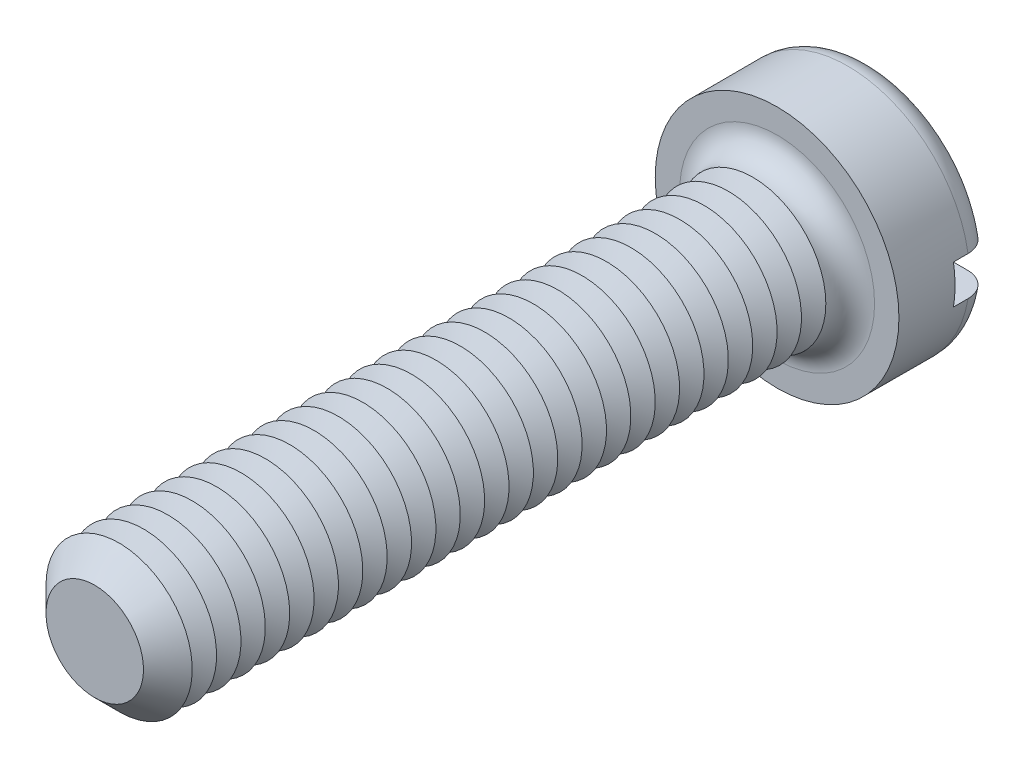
ISO-10303-21;
HEADER;
FILE_DESCRIPTION(('STEP AP214'),'2;1');
FILE_NAME('part.step','',(''),(''),'','','');
FILE_SCHEMA(('AUTOMOTIVE_DESIGN { 1 0 10303 214 1 1 1 1 }'));
ENDSEC;
DATA;
#1=APPLICATION_CONTEXT('core data for automotive mechanical design processes');
#2=APPLICATION_PROTOCOL_DEFINITION('international standard','automotive_design',2000,#1);
#3=PRODUCT_CONTEXT('',#1,'mechanical');
#4=PRODUCT('Part','Part','',(#3));
#5=PRODUCT_RELATED_PRODUCT_CATEGORY('part','',(#4));
#6=PRODUCT_DEFINITION_FORMATION('','',#4);
#7=PRODUCT_DEFINITION_CONTEXT('part definition',#1,'design');
#8=PRODUCT_DEFINITION('design','',#6,#7);
#9=PRODUCT_DEFINITION_SHAPE('','',#8);
#10=(LENGTH_UNIT() NAMED_UNIT(*) SI_UNIT(.MILLI.,.METRE.));
#11=(NAMED_UNIT(*) PLANE_ANGLE_UNIT() SI_UNIT($,.RADIAN.));
#12=(NAMED_UNIT(*) SI_UNIT($,.STERADIAN.) SOLID_ANGLE_UNIT());
#13=UNCERTAINTY_MEASURE_WITH_UNIT(LENGTH_MEASURE(1.E-05),#10,'distance_accuracy_value','');
#14=(GEOMETRIC_REPRESENTATION_CONTEXT(3) GLOBAL_UNCERTAINTY_ASSIGNED_CONTEXT((#13)) GLOBAL_UNIT_ASSIGNED_CONTEXT((#10,
#11,#12)) REPRESENTATION_CONTEXT('',''));
#15=CARTESIAN_POINT('',(0.,0.,0.));
#16=DIRECTION('',(0.,0.,1.));
#17=DIRECTION('',(1.,0.,0.));
#18=AXIS2_PLACEMENT_3D('',#15,#16,#17);
#19=CARTESIAN_POINT('',(0.,0.,-3.9));
#20=DIRECTION('',(0.,0.,1.));
#21=DIRECTION('',(1.,0.,0.));
#22=AXIS2_PLACEMENT_3D('',#19,#20,#21);
#23=PLANE('',#22);
#24=CARTESIAN_POINT('',(0.,0.,-3.9));
#25=DIRECTION('',(0.,0.,1.));
#26=DIRECTION('',(1.,0.,0.));
#27=AXIS2_PLACEMENT_3D('',#24,#25,#26);
#28=CIRCLE('',#27,4.);
#29=CARTESIAN_POINT('',(-3.91918358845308,0.800000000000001,-3.9));
#30=VERTEX_POINT('',#29);
#31=CARTESIAN_POINT('',(3.91918358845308,0.8,-3.9));
#32=VERTEX_POINT('',#31);
#33=EDGE_CURVE('E116',#30,#32,#28,.F.);
#34=ORIENTED_EDGE('',*,*,#33,.T.);
#35=DIRECTION('',(1.,0.,0.));
#36=VECTOR('',#35,1.);
#37=CARTESIAN_POINT('',(-5.,0.800000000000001,-3.9));
#38=LINE('',#37,#36);
#39=EDGE_CURVE('E111',#30,#32,#38,.T.);
#40=ORIENTED_EDGE('',*,*,#39,.F.);
#41=EDGE_LOOP('',(#34,#40));
#42=FACE_BOUND('',#41,.T.);
#43=ADVANCED_FACE('F39',(#42),#23,.F.);
#44=CARTESIAN_POINT('',(0.,0.,-2.9));
#45=DIRECTION('',(0.,0.,1.));
#46=DIRECTION('',(1.,0.,0.));
#47=AXIS2_PLACEMENT_3D('',#44,#45,#46);
#48=TOROIDAL_SURFACE('',#47,4.,1.);
#49=CARTESIAN_POINT('',(-4.76648512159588,0.800000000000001,-3.45304061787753));
#50=CARTESIAN_POINT('',(-4.73486405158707,0.800000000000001,-3.50001565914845));
#51=CARTESIAN_POINT('',(-4.69920787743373,0.800000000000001,-3.54432871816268));
#52=CARTESIAN_POINT('',(-4.62090302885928,0.800000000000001,-3.62634638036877));
#53=CARTESIAN_POINT('',(-4.57824494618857,0.800000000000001,-3.66404194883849));
#54=CARTESIAN_POINT('',(-4.48726975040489,0.800000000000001,-3.73172278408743));
#55=CARTESIAN_POINT('',(-4.43895902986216,0.800000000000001,-3.76171664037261));
#56=CARTESIAN_POINT('',(-4.33804923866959,0.800000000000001,-3.81326437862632));
#57=CARTESIAN_POINT('',(-4.2854512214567,0.800000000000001,-3.8348203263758));
#58=CARTESIAN_POINT('',(-4.17679895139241,0.800000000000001,-3.86918431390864));
#59=CARTESIAN_POINT('',(-4.12071163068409,0.800000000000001,-3.88188775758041));
#60=CARTESIAN_POINT('',(-4.00720729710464,0.800000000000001,-3.89785932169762));
#61=CARTESIAN_POINT('',(-3.94979011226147,0.800000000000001,-3.9011262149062));
#62=CARTESIAN_POINT('',(-3.83429042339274,0.800000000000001,-3.89816676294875));
#63=CARTESIAN_POINT('',(-3.77621176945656,0.800000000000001,-3.89178937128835));
#64=CARTESIAN_POINT('',(-3.66191938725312,0.800000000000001,-3.8694726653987));
#65=CARTESIAN_POINT('',(-3.60570580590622,0.800000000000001,-3.85353259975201));
#66=CARTESIAN_POINT('',(-3.49618749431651,0.800000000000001,-3.81233202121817));
#67=CARTESIAN_POINT('',(-3.44291561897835,0.800000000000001,-3.78698406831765));
#68=CARTESIAN_POINT('',(-3.34140774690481,0.800000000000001,-3.72766098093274));
#69=CARTESIAN_POINT('',(-3.29317182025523,0.800000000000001,-3.69368572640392));
#70=CARTESIAN_POINT('',(-3.20343355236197,0.800000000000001,-3.6182054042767));
#71=CARTESIAN_POINT('',(-3.16189680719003,0.800000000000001,-3.57674128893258));
#72=CARTESIAN_POINT('',(-3.08658236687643,0.800000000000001,-3.48727547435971));
#73=CARTESIAN_POINT('',(-3.05280364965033,0.800000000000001,-3.43927463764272));
#74=CARTESIAN_POINT('',(-2.99489532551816,0.800000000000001,-3.33932895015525));
#75=CARTESIAN_POINT('',(-2.97055012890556,0.800000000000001,-3.28750911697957));
#76=CARTESIAN_POINT('',(-2.93124252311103,0.800000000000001,-3.18042600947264));
#77=CARTESIAN_POINT('',(-2.91627793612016,0.800000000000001,-3.12516353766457));
#78=CARTESIAN_POINT('',(-2.89663075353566,0.800000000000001,-3.01470560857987));
#79=CARTESIAN_POINT('',(-2.89162828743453,0.800000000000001,-2.95956691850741));
#80=CARTESIAN_POINT('',(-2.89112479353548,0.800000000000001,-2.84924961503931));
#81=CARTESIAN_POINT('',(-2.89562264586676,0.800000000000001,-2.79407100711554));
#82=CARTESIAN_POINT('',(-2.91379565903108,0.800000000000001,-2.6861912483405));
#83=CARTESIAN_POINT('',(-2.92731815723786,0.800000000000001,-2.63346424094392));
#84=CARTESIAN_POINT('',(-2.96290888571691,0.800000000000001,-2.53098203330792));
#85=CARTESIAN_POINT('',(-2.98497757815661,0.800000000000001,-2.48122699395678));
#86=CARTESIAN_POINT('',(-3.03728055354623,0.800000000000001,-2.38535286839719));
#87=CARTESIAN_POINT('',(-3.06761989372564,0.800000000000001,-2.33929117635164));
#88=CARTESIAN_POINT('',(-3.13537950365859,0.800000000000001,-2.2527125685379));
#89=CARTESIAN_POINT('',(-3.17280082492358,0.800000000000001,-2.21219647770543));
#90=CARTESIAN_POINT('',(-3.2549164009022,0.800000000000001,-2.13651195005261));
#91=CARTESIAN_POINT('',(-3.29980186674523,0.800000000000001,-2.10155095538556));
#92=CARTESIAN_POINT('',(-3.39467666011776,0.800000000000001,-2.03942270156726));
#93=CARTESIAN_POINT('',(-3.44466673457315,0.800000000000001,-2.01225658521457));
#94=CARTESIAN_POINT('',(-3.5497933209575,0.800000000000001,-1.96576935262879));
#95=CARTESIAN_POINT('',(-3.60503228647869,0.800000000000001,-1.94667963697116));
#96=CARTESIAN_POINT('',(-3.71791613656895,0.800000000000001,-1.91794308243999));
#97=CARTESIAN_POINT('',(-3.77556119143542,0.800000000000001,-1.90829691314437));
#98=CARTESIAN_POINT('',(-3.89221522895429,0.800000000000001,-1.89869331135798));
#99=CARTESIAN_POINT('',(-3.9512319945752,0.800000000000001,-1.89882985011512));
#100=CARTESIAN_POINT('',(-4.06839541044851,0.800000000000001,-1.90907818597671));
#101=CARTESIAN_POINT('',(-4.12654207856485,0.800000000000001,-1.91918977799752));
#102=CARTESIAN_POINT('',(-4.23988103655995,0.800000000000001,-1.9490667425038));
#103=CARTESIAN_POINT('',(-4.29509069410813,0.800000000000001,-1.96876615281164));
#104=CARTESIAN_POINT('',(-4.40134194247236,0.800000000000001,-2.01729572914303));
#105=CARTESIAN_POINT('',(-4.45238383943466,0.800000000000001,-2.04612522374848));
#106=CARTESIAN_POINT('',(-4.54801343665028,0.800000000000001,-2.1116316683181));
#107=CARTESIAN_POINT('',(-4.59268768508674,0.800000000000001,-2.14818225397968));
#108=CARTESIAN_POINT('',(-4.67513924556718,0.800000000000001,-2.22837632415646));
#109=CARTESIAN_POINT('',(-4.71291715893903,0.800000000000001,-2.27201918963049));
#110=CARTESIAN_POINT('',(-4.77986554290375,0.800000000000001,-2.36439990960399));
#111=CARTESIAN_POINT('',(-4.80916462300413,0.800000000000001,-2.41304457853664));
#112=CARTESIAN_POINT('',(-4.85906149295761,0.800000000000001,-2.51460659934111));
#113=CARTESIAN_POINT('',(-4.8796602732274,0.800000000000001,-2.56752346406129));
#114=CARTESIAN_POINT('',(-4.9113264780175,0.800000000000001,-2.67542592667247));
#115=CARTESIAN_POINT('',(-4.92250819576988,0.800000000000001,-2.73037800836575));
#116=CARTESIAN_POINT('',(-4.93542682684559,0.800000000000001,-2.84139649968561));
#117=CARTESIAN_POINT('',(-4.93716171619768,0.800000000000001,-2.89746314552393));
#118=CARTESIAN_POINT('',(-4.93114851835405,0.800000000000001,-3.00876455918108));
#119=CARTESIAN_POINT('',(-4.92345325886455,0.800000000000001,-3.0640022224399));
#120=CARTESIAN_POINT('',(-4.8989032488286,0.800000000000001,-3.17235240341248));
#121=CARTESIAN_POINT('',(-4.88205998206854,0.800000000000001,-3.22546749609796));
#122=CARTESIAN_POINT('',(-4.84819200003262,0.800000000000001,-3.30764066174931));
#123=CARTESIAN_POINT('',(-4.83390853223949,0.800000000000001,-3.33785845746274));
#124=CARTESIAN_POINT('',(-4.80237957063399,0.800000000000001,-3.39670633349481));
#125=CARTESIAN_POINT('',(-4.78513409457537,0.800000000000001,-3.42533642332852));
#126=CARTESIAN_POINT('',(-4.76648512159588,0.800000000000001,-3.45304061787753));
#127=B_SPLINE_CURVE_WITH_KNOTS('',3,(#49,#50,#51,#52,#53,#54,#55,#56,#57,#58,#59,#60,#61,#62,
#63,#64,#65,#66,#67,#68,#69,#70,#71,#72,#73,#74,#75,#76,#77,#78,#79,#80,#81,#82,#83,#84,#85,#86,
#87,#88,#89,#90,#91,#92,#93,#94,#95,#96,#97,#98,#99,#100,#101,#102,#103,#104,#105,#106,#107,
#108,#109,#110,#111,#112,#113,#114,#115,#116,#117,#118,#119,#120,#121,#122,#123,#124,#125,#126),
.UNSPECIFIED.,.T.,.F.,(4,2,2,2,2,2,2,2,2,2,2,2,2,2,2,2,2,2,2,2,2,2,2,2,2,2,2,2,2,2,2,2,2,2,2,2,
2,2,4),(0.,0.169755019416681,0.339740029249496,0.509534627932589,0.67928763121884,
0.851013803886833,1.02276230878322,1.19722869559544,1.37170879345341,1.54785292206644,
1.72399950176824,1.89921049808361,2.07439839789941,2.24530597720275,2.41617386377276,
2.58146078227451,2.74672821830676,2.90926852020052,3.0718176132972,3.2365363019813,
3.40127946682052,3.57118676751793,3.74111896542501,3.91563534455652,4.09016409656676,
4.26636956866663,4.4425714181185,4.61757781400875,4.79257134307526,4.96489650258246,
5.13720662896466,5.30674670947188,5.47626748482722,5.64369988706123,5.81116816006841,
5.97770254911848,6.14402836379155,6.24414438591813,6.34425980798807),.UNSPECIFIED.);
#128=CARTESIAN_POINT('',(-4.93558507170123,0.800000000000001,-2.9));
#129=VERTEX_POINT('',#128);
#130=EDGE_CURVE('E387',#129,#30,#127,.T.);
#131=ORIENTED_EDGE('',*,*,#130,.F.);
#132=CARTESIAN_POINT('',(0.,0.,-2.9));
#133=DIRECTION('',(0.,0.,1.));
#134=DIRECTION('',(1.,0.,0.));
#135=AXIS2_PLACEMENT_3D('',#132,#133,#134);
#136=CIRCLE('',#135,5.);
#137=CARTESIAN_POINT('',(4.93558507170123,0.8,-2.9));
#138=VERTEX_POINT('',#137);
#139=EDGE_CURVE('E125',#138,#129,#136,.T.);
#140=ORIENTED_EDGE('',*,*,#139,.F.);
#141=CARTESIAN_POINT('',(2.98553785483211,0.8,-3.31649797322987));
#142=CARTESIAN_POINT('',(3.00991125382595,0.8,-3.36788093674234));
#143=CARTESIAN_POINT('',(3.03875556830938,0.8,-3.41719756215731));
#144=CARTESIAN_POINT('',(3.1043993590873,0.8,-3.51028676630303));
#145=CARTESIAN_POINT('',(3.1412115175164,0.8,-3.55405032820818));
#146=CARTESIAN_POINT('',(3.22153641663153,0.8,-3.63476402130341));
#147=CARTESIAN_POINT('',(3.26503706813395,0.8,-3.67172618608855));
#148=CARTESIAN_POINT('',(3.35749627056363,0.8,-3.73799476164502));
#149=CARTESIAN_POINT('',(3.4064533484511,0.8,-3.76730323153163));
#150=CARTESIAN_POINT('',(3.5095773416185,0.8,-3.81809642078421));
#151=CARTESIAN_POINT('',(3.56383317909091,0.8,-3.83940072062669));
#152=CARTESIAN_POINT('',(3.67513017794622,0.8,-3.87272481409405));
#153=CARTESIAN_POINT('',(3.7321717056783,0.8,-3.88474338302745));
#154=CARTESIAN_POINT('',(3.84815688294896,0.8,-3.89923413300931));
#155=CARTESIAN_POINT('',(3.90711516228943,0.8,-3.9015896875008));
#156=CARTESIAN_POINT('',(4.02458610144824,0.8,-3.89631753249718));
#157=CARTESIAN_POINT('',(4.08309876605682,0.8,-3.8886899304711));
#158=CARTESIAN_POINT('',(4.19768646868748,0.8,-3.86366584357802));
#159=CARTESIAN_POINT('',(4.25377243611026,0.8,-3.84631948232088));
#160=CARTESIAN_POINT('',(4.3621676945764,0.8,-3.80231797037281));
#161=CARTESIAN_POINT('',(4.41447726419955,0.8,-3.77566350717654));
#162=CARTESIAN_POINT('',(4.51300872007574,0.8,-3.71421163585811));
#163=CARTESIAN_POINT('',(4.5593085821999,0.8,-3.67953927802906));
#164=CARTESIAN_POINT('',(4.64530675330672,0.8,-3.60279495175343));
#165=CARTESIAN_POINT('',(4.68500564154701,0.8,-3.56072363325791));
#166=CARTESIAN_POINT('',(4.75599202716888,0.8,-3.47111750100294));
#167=CARTESIAN_POINT('',(4.7874061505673,0.8,-3.42368298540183));
#168=CARTESIAN_POINT('',(4.84170328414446,0.8,-3.32415927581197));
#169=CARTESIAN_POINT('',(4.86458695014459,0.8,-3.2720704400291));
#170=CARTESIAN_POINT('',(4.90088120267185,0.8,-3.16544016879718));
#171=CARTESIAN_POINT('',(4.91440984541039,0.8,-3.11093889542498));
#172=CARTESIAN_POINT('',(4.93205429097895,0.8,-3.00043391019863));
#173=CARTESIAN_POINT('',(4.93617053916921,0.8,-2.9444302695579));
#174=CARTESIAN_POINT('',(4.93486973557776,0.8,-2.83292218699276));
#175=CARTESIAN_POINT('',(4.92951827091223,0.8,-2.77741696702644));
#176=CARTESIAN_POINT('',(4.90957104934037,0.8,-2.66809456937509));
#177=CARTESIAN_POINT('',(4.89497541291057,0.8,-2.61427736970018));
#178=CARTESIAN_POINT('',(4.85697876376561,0.8,-2.50985095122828));
#179=CARTESIAN_POINT('',(4.83357805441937,0.8,-2.45924162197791));
#180=CARTESIAN_POINT('',(4.77866660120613,0.8,-2.36263484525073));
#181=CARTESIAN_POINT('',(4.74715567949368,0.8,-2.31663749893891));
#182=CARTESIAN_POINT('',(4.67670791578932,0.8,-2.23021464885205));
#183=CARTESIAN_POINT('',(4.6377224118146,0.8,-2.1898288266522));
#184=CARTESIAN_POINT('',(4.55359880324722,0.8,-2.11607828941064));
#185=CARTESIAN_POINT('',(4.50846036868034,0.8,-2.08271395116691));
#186=CARTESIAN_POINT('',(4.41271544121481,0.8,-2.02349513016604));
#187=CARTESIAN_POINT('',(4.36204749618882,0.8,-1.99774003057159));
#188=CARTESIAN_POINT('',(4.257155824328,0.8,-1.95495040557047));
#189=CARTESIAN_POINT('',(4.20293181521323,0.8,-1.93791657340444));
#190=CARTESIAN_POINT('',(4.09154156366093,0.8,-1.91276335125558));
#191=CARTESIAN_POINT('',(4.03434212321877,0.8,-1.90479098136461));
#192=CARTESIAN_POINT('',(3.91941228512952,0.8,-1.89840884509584));
#193=CARTESIAN_POINT('',(3.8616818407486,0.8,-1.89999992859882));
#194=CARTESIAN_POINT('',(3.7464111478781,0.8,-1.91275144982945));
#195=CARTESIAN_POINT('',(3.6888866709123,0.8,-1.92405471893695));
#196=CARTESIAN_POINT('',(3.57652290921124,0.8,-1.95609086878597));
#197=CARTESIAN_POINT('',(3.52168382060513,0.8,-1.97682443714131));
#198=CARTESIAN_POINT('',(3.41589179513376,0.8,-2.02733294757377));
#199=CARTESIAN_POINT('',(3.36496676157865,0.8,-2.05716640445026));
#200=CARTESIAN_POINT('',(3.26890903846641,0.8,-2.12504079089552));
#201=CARTESIAN_POINT('',(3.22377627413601,0.8,-2.16308161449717));
#202=CARTESIAN_POINT('',(3.141135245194,0.8,-2.24593284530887));
#203=CARTESIAN_POINT('',(3.1035541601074,0.8,-2.29067053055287));
#204=CARTESIAN_POINT('',(3.03669700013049,0.8,-2.38597317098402));
#205=CARTESIAN_POINT('',(3.00741914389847,0.8,-2.43653687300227));
#206=CARTESIAN_POINT('',(2.95891799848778,0.8,-2.54052959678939));
#207=CARTESIAN_POINT('',(2.93943249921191,0.8,-2.59383627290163));
#208=CARTESIAN_POINT('',(2.9100081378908,0.8,-2.70303736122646));
#209=CARTESIAN_POINT('',(2.90006970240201,0.8,-2.75893188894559));
#210=CARTESIAN_POINT('',(2.89027863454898,0.8,-2.86986958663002));
#211=CARTESIAN_POINT('',(2.89012791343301,0.8,-2.92488680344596));
#212=CARTESIAN_POINT('',(2.89917145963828,0.8,-3.03409648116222));
#213=CARTESIAN_POINT('',(2.90835313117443,0.8,-3.08828995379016));
#214=CARTESIAN_POINT('',(2.92977618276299,0.8,-3.17141652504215));
#215=CARTESIAN_POINT('',(2.93899011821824,0.8,-3.20116372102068));
#216=CARTESIAN_POINT('',(2.96020249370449,0.8,-3.25964614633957));
#217=CARTESIAN_POINT('',(2.97220082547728,0.8,-3.28838141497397));
#218=CARTESIAN_POINT('',(2.98553785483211,0.8,-3.31649797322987));
#219=B_SPLINE_CURVE_WITH_KNOTS('',3,(#141,#142,#143,#144,#145,#146,#147,#148,#149,#150,#151,
#152,#153,#154,#155,#156,#157,#158,#159,#160,#161,#162,#163,#164,#165,#166,#167,#168,#169,#170,
#171,#172,#173,#174,#175,#176,#177,#178,#179,#180,#181,#182,#183,#184,#185,#186,#187,#188,#189,
#190,#191,#192,#193,#194,#195,#196,#197,#198,#199,#200,#201,#202,#203,#204,#205,#206,#207,#208,
#209,#210,#211,#212,#213,#214,#215,#216,#217,#218),.UNSPECIFIED.,.T.,.F.,(4,2,2,2,2,2,2,2,2,2,2,
2,2,2,2,2,2,2,2,2,2,2,2,2,2,2,2,2,2,2,2,2,2,2,2,2,2,2,4),(0.,0.170493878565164,
0.341261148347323,0.511723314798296,0.682139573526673,0.856194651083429,1.03027268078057,
1.20644565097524,1.38261672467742,1.55788746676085,1.73314526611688,1.90583484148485,
2.07850925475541,2.24836742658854,2.41821253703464,2.58587311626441,2.75352576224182,
2.92002154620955,3.08651516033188,3.25300303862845,3.41949456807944,3.58710926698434,
3.75473295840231,3.92445790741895,4.09419634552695,4.26665110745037,4.43912119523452,
4.61417197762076,4.78923552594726,4.96544940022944,5.1416609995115,5.31608191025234,
5.49046537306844,5.65989063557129,5.82932346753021,5.99359365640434,6.157642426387,
6.250939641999,6.34423323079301),.UNSPECIFIED.);
#220=EDGE_CURVE('E389',#32,#138,#219,.T.);
#221=ORIENTED_EDGE('',*,*,#220,.F.);
#222=ORIENTED_EDGE('',*,*,#33,.F.);
#223=EDGE_LOOP('',(#131,#140,#221,#222));
#224=FACE_BOUND('',#223,.T.);
#225=ADVANCED_FACE('F371',(#224),#48,.T.);
#226=CARTESIAN_POINT('',(0.,0.,-3.9));
#227=DIRECTION('',(0.,0.,1.));
#228=DIRECTION('',(1.,0.,0.));
#229=AXIS2_PLACEMENT_3D('',#226,#227,#228);
#230=CYLINDRICAL_SURFACE('',#229,5.);
#231=DIRECTION('',(0.,0.,1.));
#232=VECTOR('',#231,1.);
#233=CARTESIAN_POINT('',(4.93558507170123,0.8,-3.9));
#234=LINE('',#233,#232);
#235=CARTESIAN_POINT('',(4.93558507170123,0.8,-2.3));
#236=VERTEX_POINT('',#235);
#237=EDGE_CURVE('E405',#138,#236,#234,.T.);
#238=ORIENTED_EDGE('',*,*,#237,.F.);
#239=ORIENTED_EDGE('',*,*,#139,.T.);
#240=DIRECTION('',(0.,0.,1.));
#241=VECTOR('',#240,1.);
#242=CARTESIAN_POINT('',(-4.93558507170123,0.800000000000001,-3.9));
#243=LINE('',#242,#241);
#244=CARTESIAN_POINT('',(-4.93558507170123,0.800000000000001,-2.3));
#245=VERTEX_POINT('',#244);
#246=EDGE_CURVE('E63',#245,#129,#243,.F.);
#247=ORIENTED_EDGE('',*,*,#246,.F.);
#248=CARTESIAN_POINT('',(0.,0.,-2.3));
#249=DIRECTION('',(0.,0.,-1.));
#250=DIRECTION('',(-1.,0.,0.));
#251=AXIS2_PLACEMENT_3D('',#248,#249,#250);
#252=CIRCLE('',#251,5.);
#253=CARTESIAN_POINT('',(-4.93558507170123,-0.799999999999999,-2.3));
#254=VERTEX_POINT('',#253);
#255=EDGE_CURVE('E43',#245,#254,#252,.F.);
#256=ORIENTED_EDGE('',*,*,#255,.T.);
#257=DIRECTION('',(0.,0.,1.));
#258=VECTOR('',#257,1.);
#259=CARTESIAN_POINT('',(-4.93558507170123,-0.799999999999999,-3.9));
#260=LINE('',#259,#258);
#261=CARTESIAN_POINT('',(-4.93558507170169,-0.799999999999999,-2.89999999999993));
#262=VERTEX_POINT('',#261);
#263=EDGE_CURVE('E402',#262,#254,#260,.T.);
#264=ORIENTED_EDGE('',*,*,#263,.F.);
#265=CARTESIAN_POINT('',(4.93558507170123,-0.8,-2.9));
#266=VERTEX_POINT('',#265);
#267=EDGE_CURVE('E127',#262,#266,#136,.T.);
#268=ORIENTED_EDGE('',*,*,#267,.T.);
#269=DIRECTION('',(0.,0.,1.));
#270=VECTOR('',#269,1.);
#271=CARTESIAN_POINT('',(4.93558507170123,-0.8,-3.9));
#272=LINE('',#271,#270);
#273=CARTESIAN_POINT('',(4.93558507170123,-0.8,-2.3));
#274=VERTEX_POINT('',#273);
#275=EDGE_CURVE('E55',#274,#266,#272,.F.);
#276=ORIENTED_EDGE('',*,*,#275,.F.);
#277=EDGE_CURVE('E11',#274,#236,#252,.F.);
#278=ORIENTED_EDGE('',*,*,#277,.T.);
#279=EDGE_LOOP('',(#238,#239,#247,#256,#264,#268,#276,#278));
#280=FACE_BOUND('',#279,.T.);
#281=CARTESIAN_POINT('',(0.,0.,0.));
#282=DIRECTION('',(0.,0.,1.));
#283=DIRECTION('',(1.,0.,0.));
#284=AXIS2_PLACEMENT_3D('',#281,#282,#283);
#285=CIRCLE('',#284,5.);
#286=CARTESIAN_POINT('',(5.,0.,0.));
#287=VERTEX_POINT('',#286);
#288=EDGE_CURVE('E408',#287,#287,#285,.T.);
#289=ORIENTED_EDGE('',*,*,#288,.F.);
#290=EDGE_LOOP('',(#289));
#291=FACE_BOUND('',#290,.T.);
#292=ADVANCED_FACE('F367',(#280,#291),#230,.T.);
#293=CARTESIAN_POINT('',(3.91918358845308,-0.8,-3.9));
#294=VERTEX_POINT('',#293);
#295=CARTESIAN_POINT('',(-3.91918358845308,-0.799999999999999,-3.9));
#296=VERTEX_POINT('',#295);
#297=EDGE_CURVE('E109',#294,#296,#28,.F.);
#298=ORIENTED_EDGE('',*,*,#297,.T.);
#299=DIRECTION('',(-1.,0.,0.));
#300=VECTOR('',#299,1.);
#301=CARTESIAN_POINT('',(-5.,-0.799999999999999,-3.9));
#302=LINE('',#301,#300);
#303=EDGE_CURVE('E96',#294,#296,#302,.T.);
#304=ORIENTED_EDGE('',*,*,#303,.F.);
#305=EDGE_LOOP('',(#298,#304));
#306=FACE_BOUND('',#305,.T.);
#307=ADVANCED_FACE('F108',(#306),#23,.F.);
#308=CARTESIAN_POINT('',(0.,0.,0.));
#309=DIRECTION('',(0.,0.,1.));
#310=DIRECTION('',(1.,0.,0.));
#311=AXIS2_PLACEMENT_3D('',#308,#309,#310);
#312=PLANE('',#311);
#313=CARTESIAN_POINT('',(0.,0.,0.));
#314=DIRECTION('',(0.,0.,1.));
#315=DIRECTION('',(1.,0.,0.));
#316=AXIS2_PLACEMENT_3D('',#313,#314,#315);
#317=CIRCLE('',#316,4.);
#318=CARTESIAN_POINT('',(4.,0.,0.));
#319=VERTEX_POINT('',#318);
#320=EDGE_CURVE('E115',#319,#319,#317,.F.);
#321=ORIENTED_EDGE('',*,*,#320,.T.);
#322=EDGE_LOOP('',(#321));
#323=FACE_BOUND('',#322,.T.);
#324=ORIENTED_EDGE('',*,*,#288,.T.);
#325=EDGE_LOOP('',(#324));
#326=FACE_BOUND('',#325,.T.);
#327=ADVANCED_FACE('F366',(#323,#326),#312,.T.);
#328=CARTESIAN_POINT('',(-4.76648512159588,-0.799999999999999,-3.45304061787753));
#329=CARTESIAN_POINT('',(-4.7975694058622,-0.799999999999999,-3.40685392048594));
#330=CARTESIAN_POINT('',(-4.82479903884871,-0.799999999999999,-3.35802740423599));
#331=CARTESIAN_POINT('',(-4.87070632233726,-0.799999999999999,-3.25646127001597));
#332=CARTESIAN_POINT('',(-4.8893747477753,-0.799999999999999,-3.20371750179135));
#333=CARTESIAN_POINT('',(-4.91756720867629,-0.799999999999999,-3.09584501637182));
#334=CARTESIAN_POINT('',(-4.92709302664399,-0.799999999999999,-3.04071676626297));
#335=CARTESIAN_POINT('',(-4.93671217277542,-0.799999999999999,-2.92965669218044));
#336=CARTESIAN_POINT('',(-4.93680767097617,-0.799999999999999,-2.87372505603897));
#337=CARTESIAN_POINT('',(-4.92758675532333,-0.799999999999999,-2.76284675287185));
#338=CARTESIAN_POINT('',(-4.91830421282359,-0.799999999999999,-2.70789726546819));
#339=CARTESIAN_POINT('',(-4.89065741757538,-0.799999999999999,-2.60033228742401));
#340=CARTESIAN_POINT('',(-4.87229291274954,-0.799999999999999,-2.54771686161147));
#341=CARTESIAN_POINT('',(-4.82699855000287,-0.799999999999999,-2.44622441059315));
#342=CARTESIAN_POINT('',(-4.80005659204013,-0.799999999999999,-2.39735278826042));
#343=CARTESIAN_POINT('',(-4.73841244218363,-0.799999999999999,-2.30477947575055));
#344=CARTESIAN_POINT('',(-4.70371003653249,-0.799999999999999,-2.26107792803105));
#345=CARTESIAN_POINT('',(-4.62724516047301,-0.799999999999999,-2.17969334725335));
#346=CARTESIAN_POINT('',(-4.58542787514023,-0.799999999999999,-2.14206183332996));
#347=CARTESIAN_POINT('',(-4.49614171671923,-0.799999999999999,-2.07424284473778));
#348=CARTESIAN_POINT('',(-4.44867251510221,-0.799999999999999,-2.04405580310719));
#349=CARTESIAN_POINT('',(-4.34875035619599,-0.799999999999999,-1.99153688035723));
#350=CARTESIAN_POINT('',(-4.29623870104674,-0.799999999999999,-1.96931670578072));
#351=CARTESIAN_POINT('',(-4.18826905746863,-0.799999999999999,-1.93384994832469));
#352=CARTESIAN_POINT('',(-4.1328108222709,-0.799999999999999,-1.92060411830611));
#353=CARTESIAN_POINT('',(-4.01956054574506,-0.799999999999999,-1.90323798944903));
#354=CARTESIAN_POINT('',(-3.96174522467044,-0.799999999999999,-1.89926947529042));
#355=CARTESIAN_POINT('',(-3.84625419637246,-0.799999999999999,-1.90095183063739));
#356=CARTESIAN_POINT('',(-3.78857850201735,-0.799999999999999,-1.90660355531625));
#357=CARTESIAN_POINT('',(-3.67415602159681,-0.799999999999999,-1.92748272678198));
#358=CARTESIAN_POINT('',(-3.61743328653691,-0.799999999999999,-1.94284216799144));
#359=CARTESIAN_POINT('',(-3.50734962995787,-0.799999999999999,-1.9828275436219));
#360=CARTESIAN_POINT('',(-3.4539889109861,-0.799999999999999,-2.00745403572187));
#361=CARTESIAN_POINT('',(-3.35197118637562,-0.799999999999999,-2.06542964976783));
#362=CARTESIAN_POINT('',(-3.30333217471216,-0.799999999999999,-2.0988104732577));
#363=CARTESIAN_POINT('',(-3.21244692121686,-0.799999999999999,-2.17337326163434));
#364=CARTESIAN_POINT('',(-3.17020039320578,-0.799999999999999,-2.21455487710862));
#365=CARTESIAN_POINT('',(-3.0940098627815,-0.799999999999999,-2.30296695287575));
#366=CARTESIAN_POINT('',(-3.05995540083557,-0.799999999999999,-2.35010211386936));
#367=CARTESIAN_POINT('',(-3.00053815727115,-0.799999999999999,-2.4495670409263));
#368=CARTESIAN_POINT('',(-2.97517362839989,-0.799999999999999,-2.50189576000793));
#369=CARTESIAN_POINT('',(-2.93470320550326,-0.799999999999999,-2.60853979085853));
#370=CARTESIAN_POINT('',(-2.91930557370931,-0.799999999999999,-2.66274437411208));
#371=CARTESIAN_POINT('',(-2.89812734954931,-0.799999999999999,-2.77299836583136));
#372=CARTESIAN_POINT('',(-2.89234481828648,-0.799999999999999,-2.82904740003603));
#373=CARTESIAN_POINT('',(-2.89064073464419,-0.799999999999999,-2.93970612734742));
#374=CARTESIAN_POINT('',(-2.89444549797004,-0.799999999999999,-2.99431180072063));
#375=CARTESIAN_POINT('',(-2.9112006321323,-0.799999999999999,-3.10209766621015));
#376=CARTESIAN_POINT('',(-2.9241507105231,-0.799999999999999,-3.1552779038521));
#377=CARTESIAN_POINT('',(-2.95868580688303,-0.799999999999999,-3.25858631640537));
#378=CARTESIAN_POINT('',(-2.98024709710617,-0.799999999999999,-3.30872244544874));
#379=CARTESIAN_POINT('',(-3.03128544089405,-0.799999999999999,-3.40478519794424));
#380=CARTESIAN_POINT('',(-3.06076335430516,-0.799999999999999,-3.45071136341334));
#381=CARTESIAN_POINT('',(-3.12753448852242,-0.799999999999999,-3.53826932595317));
#382=CARTESIAN_POINT('',(-3.16500083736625,-0.799999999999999,-3.57976901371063));
#383=CARTESIAN_POINT('',(-3.24617503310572,-0.799999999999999,-3.65613204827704));
#384=CARTESIAN_POINT('',(-3.28988388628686,-0.799999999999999,-3.69099432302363));
#385=CARTESIAN_POINT('',(-3.38380639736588,-0.799999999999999,-3.75424083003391));
#386=CARTESIAN_POINT('',(-3.43418287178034,-0.799999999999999,-3.78238342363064));
#387=CARTESIAN_POINT('',(-3.53887888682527,-0.799999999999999,-3.83000231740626));
#388=CARTESIAN_POINT('',(-3.59319889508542,-0.799999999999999,-3.84947758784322));
#389=CARTESIAN_POINT('',(-3.70539237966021,-0.799999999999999,-3.87954336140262));
#390=CARTESIAN_POINT('',(-3.76331464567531,-0.799999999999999,-3.88995217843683));
#391=CARTESIAN_POINT('',(-3.88008461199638,-0.799999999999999,-3.9009132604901));
#392=CARTESIAN_POINT('',(-3.93893230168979,-0.799999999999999,-3.9014656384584));
#393=CARTESIAN_POINT('',(-4.05594892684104,-0.799999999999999,-3.89264187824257));
#394=CARTESIAN_POINT('',(-4.11411702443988,-0.799999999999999,-3.88325457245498));
#395=CARTESIAN_POINT('',(-4.22802928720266,-0.799999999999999,-3.85472582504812));
#396=CARTESIAN_POINT('',(-4.28377297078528,-0.799999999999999,-3.83558245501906));
#397=CARTESIAN_POINT('',(-4.39054463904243,-0.799999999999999,-3.78829842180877));
#398=CARTESIAN_POINT('',(-4.44161887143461,-0.799999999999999,-3.76026208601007));
#399=CARTESIAN_POINT('',(-4.53818016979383,-0.799999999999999,-3.69589278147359));
#400=CARTESIAN_POINT('',(-4.58367442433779,-0.799999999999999,-3.65957066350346));
#401=CARTESIAN_POINT('',(-4.65208830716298,-0.799999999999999,-3.59453310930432));
#402=CARTESIAN_POINT('',(-4.67711825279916,-0.799999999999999,-3.56800018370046));
#403=CARTESIAN_POINT('',(-4.72414423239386,-0.799999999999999,-3.51236863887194));
#404=CARTESIAN_POINT('',(-4.74614029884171,-0.799999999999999,-3.48327004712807));
#405=CARTESIAN_POINT('',(-4.76648512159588,-0.799999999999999,-3.45304061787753));
#406=B_SPLINE_CURVE_WITH_KNOTS('',3,(#328,#329,#330,#331,#332,#333,#334,#335,#336,#337,#338,
#339,#340,#341,#342,#343,#344,#345,#346,#347,#348,#349,#350,#351,#352,#353,#354,#355,#356,#357,
#358,#359,#360,#361,#362,#363,#364,#365,#366,#367,#368,#369,#370,#371,#372,#373,#374,#375,#376,
#377,#378,#379,#380,#381,#382,#383,#384,#385,#386,#387,#388,#389,#390,#391,#392,#393,#394,#395,
#396,#397,#398,#399,#400,#401,#402,#403,#404,#405),.UNSPECIFIED.,.T.,.F.,(4,2,2,2,2,2,2,2,2,2,2,
2,2,2,2,2,2,2,2,2,2,2,2,2,2,2,2,2,2,2,2,2,2,2,2,2,2,2,4),(0.,0.166886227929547,
0.333951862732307,0.500984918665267,0.667979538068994,0.834373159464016,1.00077139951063,
1.16740542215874,1.33404403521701,1.50202999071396,1.67002571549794,1.84029248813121,
2.01057354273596,2.18362161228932,2.35668506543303,2.53215380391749,2.70763310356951,
2.88375684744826,3.05987270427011,3.23346085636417,3.40701408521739,3.57522519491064,
3.74340238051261,3.90683338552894,4.0702591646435,4.23323770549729,4.39623395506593,
4.56320691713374,4.7302068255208,4.90252468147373,5.07486300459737,5.25058028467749,
5.42629555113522,5.60220844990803,5.77815613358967,5.95211162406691,6.12584060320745,
6.23506966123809,6.34429754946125),.UNSPECIFIED.);
#407=EDGE_CURVE('E103',#296,#262,#406,.T.);
#408=ORIENTED_EDGE('',*,*,#407,.F.);
#409=ORIENTED_EDGE('',*,*,#297,.F.);
#410=CARTESIAN_POINT('',(2.98553785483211,-0.8,-3.31649797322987));
#411=CARTESIAN_POINT('',(2.96216773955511,-0.8,-3.26721849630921));
#412=CARTESIAN_POINT('',(2.94287503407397,-0.8,-3.21596872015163));
#413=CARTESIAN_POINT('',(2.91313258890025,-0.8,-3.11092723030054));
#414=CARTESIAN_POINT('',(2.9026902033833,-0.8,-3.0571334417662));
#415=CARTESIAN_POINT('',(2.89104377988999,-0.8,-2.94853922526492));
#416=CARTESIAN_POINT('',(2.88984130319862,-0.8,-2.89373862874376));
#417=CARTESIAN_POINT('',(2.89672585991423,-0.8,-2.78473646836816));
#418=CARTESIAN_POINT('',(2.90481120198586,-0.8,-2.73053479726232));
#419=CARTESIAN_POINT('',(2.92989134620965,-0.8,-2.62460092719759));
#420=CARTESIAN_POINT('',(2.94682969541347,-0.8,-2.57285532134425));
#421=CARTESIAN_POINT('',(2.9889990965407,-0.8,-2.47286425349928));
#422=CARTESIAN_POINT('',(3.01423103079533,-0.8,-2.42461916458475));
#423=CARTESIAN_POINT('',(3.07271536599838,-0.8,-2.33201565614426));
#424=CARTESIAN_POINT('',(3.10610710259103,-0.8,-2.28774532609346));
#425=CARTESIAN_POINT('',(3.17963417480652,-0.8,-2.205215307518));
#426=CARTESIAN_POINT('',(3.21977054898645,-0.8,-2.16695654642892));
#427=CARTESIAN_POINT('',(3.3070361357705,-0.8,-2.09624274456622));
#428=CARTESIAN_POINT('',(3.35434874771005,-0.8,-2.06401396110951));
#429=CARTESIAN_POINT('',(3.45361131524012,-0.8,-2.00773436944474));
#430=CARTESIAN_POINT('',(3.50556189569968,-0.8,-1.98368466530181));
#431=CARTESIAN_POINT('',(3.61398433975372,-0.8,-1.94389460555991));
#432=CARTESIAN_POINT('',(3.67053506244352,-0.8,-1.92836880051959));
#433=CARTESIAN_POINT('',(3.78543606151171,-0.8,-1.90696594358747));
#434=CARTESIAN_POINT('',(3.84378643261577,-0.8,-1.90108940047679));
#435=CARTESIAN_POINT('',(3.96100201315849,-0.8,-1.89918115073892));
#436=CARTESIAN_POINT('',(4.01986821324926,-0.8,-1.90320860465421));
#437=CARTESIAN_POINT('',(4.13606891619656,-0.8,-1.9211820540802));
#438=CARTESIAN_POINT('',(4.19340347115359,-0.8,-1.93512771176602));
#439=CARTESIAN_POINT('',(4.30434213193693,-0.8,-1.97243705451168));
#440=CARTESIAN_POINT('',(4.35797549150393,-0.8,-1.99571368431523));
#441=CARTESIAN_POINT('',(4.46048254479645,-0.8,-2.0510826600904));
#442=CARTESIAN_POINT('',(4.50935662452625,-0.8,-2.08317429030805));
#443=CARTESIAN_POINT('',(4.60012348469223,-0.8,-2.15471647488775));
#444=CARTESIAN_POINT('',(4.64211506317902,-0.8,-2.19404167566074));
#445=CARTESIAN_POINT('',(4.71877054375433,-0.8,-2.27928299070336));
#446=CARTESIAN_POINT('',(4.75343508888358,-0.8,-2.32519852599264));
#447=CARTESIAN_POINT('',(4.81388799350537,-0.8,-2.4215411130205));
#448=CARTESIAN_POINT('',(4.83980652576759,-0.8,-2.47188650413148));
#449=CARTESIAN_POINT('',(4.88271402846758,-0.8,-2.57624865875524));
#450=CARTESIAN_POINT('',(4.89970360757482,-0.8,-2.63026517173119));
#451=CARTESIAN_POINT('',(4.92409334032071,-0.8,-2.73978844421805));
#452=CARTESIAN_POINT('',(4.93159814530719,-0.8,-2.79527191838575));
#453=CARTESIAN_POINT('',(4.93713723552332,-0.8,-2.90670881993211));
#454=CARTESIAN_POINT('',(4.9351718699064,-0.8,-2.9626622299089));
#455=CARTESIAN_POINT('',(4.92186293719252,-0.8,-3.07317093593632));
#456=CARTESIAN_POINT('',(4.91056393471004,-0.8,-3.12773160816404));
#457=CARTESIAN_POINT('',(4.87898532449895,-0.8,-3.234187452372));
#458=CARTESIAN_POINT('',(4.85870572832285,-0.8,-3.28608262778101));
#459=CARTESIAN_POINT('',(4.80971634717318,-0.8,-3.38586723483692));
#460=CARTESIAN_POINT('',(4.78098824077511,-0.8,-3.43374766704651));
#461=CARTESIAN_POINT('',(4.71596686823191,-0.8,-3.52405937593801));
#462=CARTESIAN_POINT('',(4.67967336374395,-0.8,-3.56649048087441));
#463=CARTESIAN_POINT('',(4.60022577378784,-0.8,-3.64511036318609));
#464=CARTESIAN_POINT('',(4.5570143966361,-0.8,-3.6812412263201));
#465=CARTESIAN_POINT('',(4.4652099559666,-0.8,-3.7458530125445));
#466=CARTESIAN_POINT('',(4.41661654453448,-0.8,-3.77433344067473));
#467=CARTESIAN_POINT('',(4.31470683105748,-0.8,-3.82326981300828));
#468=CARTESIAN_POINT('',(4.26133399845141,-0.8,-3.84360800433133));
#469=CARTESIAN_POINT('',(4.15196444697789,-0.8,-3.87519515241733));
#470=CARTESIAN_POINT('',(4.09596750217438,-0.8,-3.88644332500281));
#471=CARTESIAN_POINT('',(3.98196469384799,-0.8,-3.89971870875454));
#472=CARTESIAN_POINT('',(3.92394096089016,-0.8,-3.901592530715));
#473=CARTESIAN_POINT('',(3.8083852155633,-0.8,-3.89570840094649));
#474=CARTESIAN_POINT('',(3.75085322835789,-0.8,-3.88794995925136));
#475=CARTESIAN_POINT('',(3.6371167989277,-0.8,-3.86287824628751));
#476=CARTESIAN_POINT('',(3.58093962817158,-0.8,-3.84544111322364));
#477=CARTESIAN_POINT('',(3.47227948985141,-0.8,-3.80139971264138));
#478=CARTESIAN_POINT('',(3.41979762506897,-0.8,-3.77479272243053));
#479=CARTESIAN_POINT('',(3.31994061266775,-0.8,-3.71304199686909));
#480=CARTESIAN_POINT('',(3.27257854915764,-0.8,-3.67787710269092));
#481=CARTESIAN_POINT('',(3.18459619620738,-0.8,-3.59999704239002));
#482=CARTESIAN_POINT('',(3.14396747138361,-0.8,-3.55729146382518));
#483=CARTESIAN_POINT('',(3.08341110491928,-0.8,-3.48140072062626));
#484=CARTESIAN_POINT('',(3.06118126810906,-0.8,-3.45002448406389));
#485=CARTESIAN_POINT('',(3.02047302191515,-0.8,-3.38492378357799));
#486=CARTESIAN_POINT('',(3.00199451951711,-0.8,-3.35119937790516));
#487=CARTESIAN_POINT('',(2.98553785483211,-0.8,-3.31649797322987));
#488=B_SPLINE_CURVE_WITH_KNOTS('',3,(#410,#411,#412,#413,#414,#415,#416,#417,#418,#419,#420,
#421,#422,#423,#424,#425,#426,#427,#428,#429,#430,#431,#432,#433,#434,#435,#436,#437,#438,#439,
#440,#441,#442,#443,#444,#445,#446,#447,#448,#449,#450,#451,#452,#453,#454,#455,#456,#457,#458,
#459,#460,#461,#462,#463,#464,#465,#466,#467,#468,#469,#470,#471,#472,#473,#474,#475,#476,#477,
#478,#479,#480,#481,#482,#483,#484,#485,#486,#487),.UNSPECIFIED.,.T.,.F.,(4,2,2,2,2,2,2,2,2,2,2,
2,2,2,2,2,2,2,2,2,2,2,2,2,2,2,2,2,2,2,2,2,2,2,2,2,2,2,4),(0.,0.163484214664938,
0.327104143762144,0.490751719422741,0.654369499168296,0.816956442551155,0.979560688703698,
1.14516376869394,1.31079237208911,1.48174839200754,1.6527274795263,1.82783306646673,
2.00294788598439,2.17911127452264,2.35526866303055,2.52981944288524,2.70435605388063,
2.87611266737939,3.04785420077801,3.21691347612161,3.38596122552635,3.55312700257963,
3.72028661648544,3.88665268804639,4.053018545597,4.2197478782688,4.38648246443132,
4.55467705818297,4.72288253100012,4.89343959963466,5.06401138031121,5.23736524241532,
5.41072792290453,5.58636211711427,5.76204850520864,5.93817375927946,6.11407667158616,
6.22920111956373,6.34432271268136),.UNSPECIFIED.);
#489=EDGE_CURVE('E92',#266,#294,#488,.T.);
#490=ORIENTED_EDGE('',*,*,#489,.F.);
#491=ORIENTED_EDGE('',*,*,#267,.F.);
#492=EDGE_LOOP('',(#408,#409,#490,#491));
#493=FACE_BOUND('',#492,.T.);
#494=ADVANCED_FACE('F113',(#493),#48,.T.);
#495=CARTESIAN_POINT('',(0.,0.,1.));
#496=DIRECTION('',(0.,0.,1.));
#497=DIRECTION('',(1.,0.,0.));
#498=AXIS2_PLACEMENT_3D('',#495,#496,#497);
#499=TOROIDAL_SURFACE('',#498,4.,1.);
#500=ORIENTED_EDGE('',*,*,#320,.F.);
#501=EDGE_LOOP('',(#500));
#502=FACE_BOUND('',#501,.T.);
#503=CARTESIAN_POINT('',(0.,0.,1.));
#504=DIRECTION('',(0.,0.,-1.));
#505=DIRECTION('',(-1.,0.,0.));
#506=AXIS2_PLACEMENT_3D('',#503,#504,#505);
#507=CIRCLE('',#506,3.);
#508=CARTESIAN_POINT('',(-3.,0.,1.));
#509=VERTEX_POINT('',#508);
#510=EDGE_CURVE('E414',#509,#509,#507,.T.);
#511=ORIENTED_EDGE('',*,*,#510,.T.);
#512=EDGE_LOOP('',(#511));
#513=FACE_BOUND('',#512,.T.);
#514=ADVANCED_FACE('F359',(#502,#513),#499,.F.);
#515=CARTESIAN_POINT('',(0.,0.,1.5));
#516=DIRECTION('',(0.,0.,-1.));
#517=DIRECTION('',(-1.,0.,0.));
#518=AXIS2_PLACEMENT_3D('',#515,#516,#517);
#519=CONICAL_SURFACE('',#518,2.13397459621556,1.0471975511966);
#520=ORIENTED_EDGE('',*,*,#510,.F.);
#521=EDGE_LOOP('',(#520));
#522=FACE_BOUND('',#521,.T.);
#523=CARTESIAN_POINT('',(0.,0.,1.5));
#524=DIRECTION('',(0.,0.,-1.));
#525=DIRECTION('',(-1.,0.,0.));
#526=AXIS2_PLACEMENT_3D('',#523,#524,#525);
#527=CIRCLE('',#526,2.13397459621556);
#528=CARTESIAN_POINT('',(-2.13397459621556,0.,1.5));
#529=VERTEX_POINT('',#528);
#530=EDGE_CURVE('E420',#529,#529,#527,.T.);
#531=ORIENTED_EDGE('',*,*,#530,.T.);
#532=EDGE_LOOP('',(#531));
#533=FACE_BOUND('',#532,.T.);
#534=ADVANCED_FACE('F355',(#522,#533),#519,.T.);
#535=CARTESIAN_POINT('',(0.,0.,2.));
#536=DIRECTION('',(0.,0.,1.));
#537=DIRECTION('',(1.,0.,0.));
#538=AXIS2_PLACEMENT_3D('',#535,#536,#537);
#539=CONICAL_SURFACE('',#538,3.,1.0471975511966);
#540=ORIENTED_EDGE('',*,*,#530,.F.);
#541=EDGE_LOOP('',(#540));
#542=FACE_BOUND('',#541,.T.);
#543=CARTESIAN_POINT('',(0.,0.,2.));
#544=DIRECTION('',(0.,0.,-1.));
#545=DIRECTION('',(-1.,0.,0.));
#546=AXIS2_PLACEMENT_3D('',#543,#544,#545);
#547=CIRCLE('',#546,3.);
#548=CARTESIAN_POINT('',(-3.,0.,2.));
#549=VERTEX_POINT('',#548);
#550=EDGE_CURVE('E425',#549,#549,#547,.T.);
#551=ORIENTED_EDGE('',*,*,#550,.T.);
#552=EDGE_LOOP('',(#551));
#553=FACE_BOUND('',#552,.T.);
#554=ADVANCED_FACE('F351',(#542,#553),#539,.T.);
#555=CARTESIAN_POINT('',(0.,0.,2.5));
#556=DIRECTION('',(0.,0.,-1.));
#557=DIRECTION('',(-1.,0.,0.));
#558=AXIS2_PLACEMENT_3D('',#555,#556,#557);
#559=CONICAL_SURFACE('',#558,2.13397459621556,1.0471975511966);
#560=ORIENTED_EDGE('',*,*,#550,.F.);
#561=EDGE_LOOP('',(#560));
#562=FACE_BOUND('',#561,.T.);
#563=CARTESIAN_POINT('',(0.,0.,2.5));
#564=DIRECTION('',(0.,0.,-1.));
#565=DIRECTION('',(-1.,0.,0.));
#566=AXIS2_PLACEMENT_3D('',#563,#564,#565);
#567=CIRCLE('',#566,2.13397459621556);
#568=CARTESIAN_POINT('',(-2.13397459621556,0.,2.5));
#569=VERTEX_POINT('',#568);
#570=EDGE_CURVE('E429',#569,#569,#567,.T.);
#571=ORIENTED_EDGE('',*,*,#570,.T.);
#572=EDGE_LOOP('',(#571));
#573=FACE_BOUND('',#572,.T.);
#574=ADVANCED_FACE('F347',(#562,#573),#559,.T.);
#575=CARTESIAN_POINT('',(0.,0.,3.));
#576=DIRECTION('',(0.,0.,1.));
#577=DIRECTION('',(1.,0.,0.));
#578=AXIS2_PLACEMENT_3D('',#575,#576,#577);
#579=CONICAL_SURFACE('',#578,3.,1.0471975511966);
#580=ORIENTED_EDGE('',*,*,#570,.F.);
#581=EDGE_LOOP('',(#580));
#582=FACE_BOUND('',#581,.T.);
#583=CARTESIAN_POINT('',(0.,0.,3.));
#584=DIRECTION('',(0.,0.,-1.));
#585=DIRECTION('',(-1.,0.,0.));
#586=AXIS2_PLACEMENT_3D('',#583,#584,#585);
#587=CIRCLE('',#586,3.);
#588=CARTESIAN_POINT('',(-3.,0.,3.));
#589=VERTEX_POINT('',#588);
#590=EDGE_CURVE('E433',#589,#589,#587,.T.);
#591=ORIENTED_EDGE('',*,*,#590,.T.);
#592=EDGE_LOOP('',(#591));
#593=FACE_BOUND('',#592,.T.);
#594=ADVANCED_FACE('F343',(#582,#593),#579,.T.);
#595=CARTESIAN_POINT('',(0.,0.,3.5));
#596=DIRECTION('',(0.,0.,-1.));
#597=DIRECTION('',(-1.,0.,0.));
#598=AXIS2_PLACEMENT_3D('',#595,#596,#597);
#599=CONICAL_SURFACE('',#598,2.13397459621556,1.0471975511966);
#600=ORIENTED_EDGE('',*,*,#590,.F.);
#601=EDGE_LOOP('',(#600));
#602=FACE_BOUND('',#601,.T.);
#603=CARTESIAN_POINT('',(0.,0.,3.5));
#604=DIRECTION('',(0.,0.,-1.));
#605=DIRECTION('',(-1.,0.,0.));
#606=AXIS2_PLACEMENT_3D('',#603,#604,#605);
#607=CIRCLE('',#606,2.13397459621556);
#608=CARTESIAN_POINT('',(-2.13397459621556,0.,3.5));
#609=VERTEX_POINT('',#608);
#610=EDGE_CURVE('E437',#609,#609,#607,.T.);
#611=ORIENTED_EDGE('',*,*,#610,.T.);
#612=EDGE_LOOP('',(#611));
#613=FACE_BOUND('',#612,.T.);
#614=ADVANCED_FACE('F339',(#602,#613),#599,.T.);
#615=CARTESIAN_POINT('',(0.,0.,4.));
#616=DIRECTION('',(0.,0.,1.));
#617=DIRECTION('',(1.,0.,0.));
#618=AXIS2_PLACEMENT_3D('',#615,#616,#617);
#619=CONICAL_SURFACE('',#618,3.,1.0471975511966);
#620=ORIENTED_EDGE('',*,*,#610,.F.);
#621=EDGE_LOOP('',(#620));
#622=FACE_BOUND('',#621,.T.);
#623=CARTESIAN_POINT('',(0.,0.,4.));
#624=DIRECTION('',(0.,0.,-1.));
#625=DIRECTION('',(-1.,0.,0.));
#626=AXIS2_PLACEMENT_3D('',#623,#624,#625);
#627=CIRCLE('',#626,3.);
#628=CARTESIAN_POINT('',(-3.,0.,4.));
#629=VERTEX_POINT('',#628);
#630=EDGE_CURVE('E441',#629,#629,#627,.T.);
#631=ORIENTED_EDGE('',*,*,#630,.T.);
#632=EDGE_LOOP('',(#631));
#633=FACE_BOUND('',#632,.T.);
#634=ADVANCED_FACE('F335',(#622,#633),#619,.T.);
#635=CARTESIAN_POINT('',(0.,0.,4.5));
#636=DIRECTION('',(0.,0.,-1.));
#637=DIRECTION('',(-1.,0.,0.));
#638=AXIS2_PLACEMENT_3D('',#635,#636,#637);
#639=CONICAL_SURFACE('',#638,2.13397459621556,1.0471975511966);
#640=ORIENTED_EDGE('',*,*,#630,.F.);
#641=EDGE_LOOP('',(#640));
#642=FACE_BOUND('',#641,.T.);
#643=CARTESIAN_POINT('',(0.,0.,4.5));
#644=DIRECTION('',(0.,0.,-1.));
#645=DIRECTION('',(-1.,0.,0.));
#646=AXIS2_PLACEMENT_3D('',#643,#644,#645);
#647=CIRCLE('',#646,2.13397459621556);
#648=CARTESIAN_POINT('',(-2.13397459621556,0.,4.5));
#649=VERTEX_POINT('',#648);
#650=EDGE_CURVE('E445',#649,#649,#647,.T.);
#651=ORIENTED_EDGE('',*,*,#650,.T.);
#652=EDGE_LOOP('',(#651));
#653=FACE_BOUND('',#652,.T.);
#654=ADVANCED_FACE('F331',(#642,#653),#639,.T.);
#655=CARTESIAN_POINT('',(0.,0.,5.));
#656=DIRECTION('',(0.,0.,1.));
#657=DIRECTION('',(1.,0.,0.));
#658=AXIS2_PLACEMENT_3D('',#655,#656,#657);
#659=CONICAL_SURFACE('',#658,3.,1.0471975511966);
#660=ORIENTED_EDGE('',*,*,#650,.F.);
#661=EDGE_LOOP('',(#660));
#662=FACE_BOUND('',#661,.T.);
#663=CARTESIAN_POINT('',(0.,0.,5.));
#664=DIRECTION('',(0.,0.,-1.));
#665=DIRECTION('',(-1.,0.,0.));
#666=AXIS2_PLACEMENT_3D('',#663,#664,#665);
#667=CIRCLE('',#666,3.);
#668=CARTESIAN_POINT('',(-3.,0.,5.));
#669=VERTEX_POINT('',#668);
#670=EDGE_CURVE('E449',#669,#669,#667,.T.);
#671=ORIENTED_EDGE('',*,*,#670,.T.);
#672=EDGE_LOOP('',(#671));
#673=FACE_BOUND('',#672,.T.);
#674=ADVANCED_FACE('F327',(#662,#673),#659,.T.);
#675=CARTESIAN_POINT('',(0.,0.,5.5));
#676=DIRECTION('',(0.,0.,-1.));
#677=DIRECTION('',(-1.,0.,0.));
#678=AXIS2_PLACEMENT_3D('',#675,#676,#677);
#679=CONICAL_SURFACE('',#678,2.13397459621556,1.0471975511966);
#680=ORIENTED_EDGE('',*,*,#670,.F.);
#681=EDGE_LOOP('',(#680));
#682=FACE_BOUND('',#681,.T.);
#683=CARTESIAN_POINT('',(0.,0.,5.5));
#684=DIRECTION('',(0.,0.,-1.));
#685=DIRECTION('',(-1.,0.,0.));
#686=AXIS2_PLACEMENT_3D('',#683,#684,#685);
#687=CIRCLE('',#686,2.13397459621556);
#688=CARTESIAN_POINT('',(-2.13397459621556,0.,5.5));
#689=VERTEX_POINT('',#688);
#690=EDGE_CURVE('E453',#689,#689,#687,.T.);
#691=ORIENTED_EDGE('',*,*,#690,.T.);
#692=EDGE_LOOP('',(#691));
#693=FACE_BOUND('',#692,.T.);
#694=ADVANCED_FACE('F323',(#682,#693),#679,.T.);
#695=CARTESIAN_POINT('',(0.,0.,6.));
#696=DIRECTION('',(0.,0.,1.));
#697=DIRECTION('',(1.,0.,0.));
#698=AXIS2_PLACEMENT_3D('',#695,#696,#697);
#699=CONICAL_SURFACE('',#698,3.,1.0471975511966);
#700=ORIENTED_EDGE('',*,*,#690,.F.);
#701=EDGE_LOOP('',(#700));
#702=FACE_BOUND('',#701,.T.);
#703=CARTESIAN_POINT('',(0.,0.,6.));
#704=DIRECTION('',(0.,0.,-1.));
#705=DIRECTION('',(-1.,0.,0.));
#706=AXIS2_PLACEMENT_3D('',#703,#704,#705);
#707=CIRCLE('',#706,3.);
#708=CARTESIAN_POINT('',(-3.,0.,6.));
#709=VERTEX_POINT('',#708);
#710=EDGE_CURVE('E456',#709,#709,#707,.T.);
#711=ORIENTED_EDGE('',*,*,#710,.T.);
#712=EDGE_LOOP('',(#711));
#713=FACE_BOUND('',#712,.T.);
#714=ADVANCED_FACE('F319',(#702,#713),#699,.T.);
#715=CARTESIAN_POINT('',(0.,0.,6.5));
#716=DIRECTION('',(0.,0.,-1.));
#717=DIRECTION('',(-1.,0.,0.));
#718=AXIS2_PLACEMENT_3D('',#715,#716,#717);
#719=CONICAL_SURFACE('',#718,2.13397459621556,1.0471975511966);
#720=ORIENTED_EDGE('',*,*,#710,.F.);
#721=EDGE_LOOP('',(#720));
#722=FACE_BOUND('',#721,.T.);
#723=CARTESIAN_POINT('',(0.,0.,6.5));
#724=DIRECTION('',(0.,0.,-1.));
#725=DIRECTION('',(-1.,0.,0.));
#726=AXIS2_PLACEMENT_3D('',#723,#724,#725);
#727=CIRCLE('',#726,2.13397459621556);
#728=CARTESIAN_POINT('',(-2.13397459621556,0.,6.5));
#729=VERTEX_POINT('',#728);
#730=EDGE_CURVE('E459',#729,#729,#727,.T.);
#731=ORIENTED_EDGE('',*,*,#730,.T.);
#732=EDGE_LOOP('',(#731));
#733=FACE_BOUND('',#732,.T.);
#734=ADVANCED_FACE('F315',(#722,#733),#719,.T.);
#735=CARTESIAN_POINT('',(0.,0.,7.));
#736=DIRECTION('',(0.,0.,1.));
#737=DIRECTION('',(1.,0.,0.));
#738=AXIS2_PLACEMENT_3D('',#735,#736,#737);
#739=CONICAL_SURFACE('',#738,3.,1.0471975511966);
#740=ORIENTED_EDGE('',*,*,#730,.F.);
#741=EDGE_LOOP('',(#740));
#742=FACE_BOUND('',#741,.T.);
#743=CARTESIAN_POINT('',(0.,0.,7.));
#744=DIRECTION('',(0.,0.,-1.));
#745=DIRECTION('',(-1.,0.,0.));
#746=AXIS2_PLACEMENT_3D('',#743,#744,#745);
#747=CIRCLE('',#746,3.);
#748=CARTESIAN_POINT('',(-3.,0.,7.));
#749=VERTEX_POINT('',#748);
#750=EDGE_CURVE('E463',#749,#749,#747,.T.);
#751=ORIENTED_EDGE('',*,*,#750,.T.);
#752=EDGE_LOOP('',(#751));
#753=FACE_BOUND('',#752,.T.);
#754=ADVANCED_FACE('F311',(#742,#753),#739,.T.);
#755=CARTESIAN_POINT('',(0.,0.,7.5));
#756=DIRECTION('',(0.,0.,-1.));
#757=DIRECTION('',(-1.,0.,0.));
#758=AXIS2_PLACEMENT_3D('',#755,#756,#757);
#759=CONICAL_SURFACE('',#758,2.13397459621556,1.0471975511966);
#760=ORIENTED_EDGE('',*,*,#750,.F.);
#761=EDGE_LOOP('',(#760));
#762=FACE_BOUND('',#761,.T.);
#763=CARTESIAN_POINT('',(0.,0.,7.5));
#764=DIRECTION('',(0.,0.,-1.));
#765=DIRECTION('',(-1.,0.,0.));
#766=AXIS2_PLACEMENT_3D('',#763,#764,#765);
#767=CIRCLE('',#766,2.13397459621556);
#768=CARTESIAN_POINT('',(-2.13397459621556,0.,7.5));
#769=VERTEX_POINT('',#768);
#770=EDGE_CURVE('E466',#769,#769,#767,.T.);
#771=ORIENTED_EDGE('',*,*,#770,.T.);
#772=EDGE_LOOP('',(#771));
#773=FACE_BOUND('',#772,.T.);
#774=ADVANCED_FACE('F307',(#762,#773),#759,.T.);
#775=CARTESIAN_POINT('',(0.,0.,8.));
#776=DIRECTION('',(0.,0.,1.));
#777=DIRECTION('',(1.,0.,0.));
#778=AXIS2_PLACEMENT_3D('',#775,#776,#777);
#779=CONICAL_SURFACE('',#778,3.,1.0471975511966);
#780=ORIENTED_EDGE('',*,*,#770,.F.);
#781=EDGE_LOOP('',(#780));
#782=FACE_BOUND('',#781,.T.);
#783=CARTESIAN_POINT('',(0.,0.,8.));
#784=DIRECTION('',(0.,0.,-1.));
#785=DIRECTION('',(-1.,0.,0.));
#786=AXIS2_PLACEMENT_3D('',#783,#784,#785);
#787=CIRCLE('',#786,3.);
#788=CARTESIAN_POINT('',(-3.,0.,8.));
#789=VERTEX_POINT('',#788);
#790=EDGE_CURVE('E470',#789,#789,#787,.T.);
#791=ORIENTED_EDGE('',*,*,#790,.T.);
#792=EDGE_LOOP('',(#791));
#793=FACE_BOUND('',#792,.T.);
#794=ADVANCED_FACE('F303',(#782,#793),#779,.T.);
#795=CARTESIAN_POINT('',(0.,0.,8.5));
#796=DIRECTION('',(0.,0.,-1.));
#797=DIRECTION('',(-1.,0.,0.));
#798=AXIS2_PLACEMENT_3D('',#795,#796,#797);
#799=CONICAL_SURFACE('',#798,2.13397459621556,1.0471975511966);
#800=ORIENTED_EDGE('',*,*,#790,.F.);
#801=EDGE_LOOP('',(#800));
#802=FACE_BOUND('',#801,.T.);
#803=CARTESIAN_POINT('',(0.,0.,8.5));
#804=DIRECTION('',(0.,0.,-1.));
#805=DIRECTION('',(-1.,0.,0.));
#806=AXIS2_PLACEMENT_3D('',#803,#804,#805);
#807=CIRCLE('',#806,2.13397459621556);
#808=CARTESIAN_POINT('',(-2.13397459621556,0.,8.5));
#809=VERTEX_POINT('',#808);
#810=EDGE_CURVE('E473',#809,#809,#807,.T.);
#811=ORIENTED_EDGE('',*,*,#810,.T.);
#812=EDGE_LOOP('',(#811));
#813=FACE_BOUND('',#812,.T.);
#814=ADVANCED_FACE('F299',(#802,#813),#799,.T.);
#815=CARTESIAN_POINT('',(0.,0.,9.));
#816=DIRECTION('',(0.,0.,1.));
#817=DIRECTION('',(1.,0.,0.));
#818=AXIS2_PLACEMENT_3D('',#815,#816,#817);
#819=CONICAL_SURFACE('',#818,3.,1.0471975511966);
#820=ORIENTED_EDGE('',*,*,#810,.F.);
#821=EDGE_LOOP('',(#820));
#822=FACE_BOUND('',#821,.T.);
#823=CARTESIAN_POINT('',(0.,0.,9.));
#824=DIRECTION('',(0.,0.,-1.));
#825=DIRECTION('',(-1.,0.,0.));
#826=AXIS2_PLACEMENT_3D('',#823,#824,#825);
#827=CIRCLE('',#826,3.);
#828=CARTESIAN_POINT('',(-3.,0.,9.));
#829=VERTEX_POINT('',#828);
#830=EDGE_CURVE('E477',#829,#829,#827,.T.);
#831=ORIENTED_EDGE('',*,*,#830,.T.);
#832=EDGE_LOOP('',(#831));
#833=FACE_BOUND('',#832,.T.);
#834=ADVANCED_FACE('F295',(#822,#833),#819,.T.);
#835=CARTESIAN_POINT('',(0.,0.,9.5));
#836=DIRECTION('',(0.,0.,-1.));
#837=DIRECTION('',(-1.,0.,0.));
#838=AXIS2_PLACEMENT_3D('',#835,#836,#837);
#839=CONICAL_SURFACE('',#838,2.13397459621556,1.0471975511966);
#840=ORIENTED_EDGE('',*,*,#830,.F.);
#841=EDGE_LOOP('',(#840));
#842=FACE_BOUND('',#841,.T.);
#843=CARTESIAN_POINT('',(0.,0.,9.5));
#844=DIRECTION('',(0.,0.,-1.));
#845=DIRECTION('',(-1.,0.,0.));
#846=AXIS2_PLACEMENT_3D('',#843,#844,#845);
#847=CIRCLE('',#846,2.13397459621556);
#848=CARTESIAN_POINT('',(-2.13397459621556,0.,9.5));
#849=VERTEX_POINT('',#848);
#850=EDGE_CURVE('E481',#849,#849,#847,.T.);
#851=ORIENTED_EDGE('',*,*,#850,.T.);
#852=EDGE_LOOP('',(#851));
#853=FACE_BOUND('',#852,.T.);
#854=ADVANCED_FACE('F291',(#842,#853),#839,.T.);
#855=CARTESIAN_POINT('',(0.,0.,10.));
#856=DIRECTION('',(0.,0.,1.));
#857=DIRECTION('',(1.,0.,0.));
#858=AXIS2_PLACEMENT_3D('',#855,#856,#857);
#859=CONICAL_SURFACE('',#858,3.,1.0471975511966);
#860=ORIENTED_EDGE('',*,*,#850,.F.);
#861=EDGE_LOOP('',(#860));
#862=FACE_BOUND('',#861,.T.);
#863=CARTESIAN_POINT('',(0.,0.,10.));
#864=DIRECTION('',(0.,0.,-1.));
#865=DIRECTION('',(-1.,0.,0.));
#866=AXIS2_PLACEMENT_3D('',#863,#864,#865);
#867=CIRCLE('',#866,3.);
#868=CARTESIAN_POINT('',(-3.,0.,10.));
#869=VERTEX_POINT('',#868);
#870=EDGE_CURVE('E485',#869,#869,#867,.T.);
#871=ORIENTED_EDGE('',*,*,#870,.T.);
#872=EDGE_LOOP('',(#871));
#873=FACE_BOUND('',#872,.T.);
#874=ADVANCED_FACE('F287',(#862,#873),#859,.T.);
#875=CARTESIAN_POINT('',(0.,0.,10.5));
#876=DIRECTION('',(0.,0.,-1.));
#877=DIRECTION('',(-1.,0.,0.));
#878=AXIS2_PLACEMENT_3D('',#875,#876,#877);
#879=CONICAL_SURFACE('',#878,2.13397459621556,1.0471975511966);
#880=ORIENTED_EDGE('',*,*,#870,.F.);
#881=EDGE_LOOP('',(#880));
#882=FACE_BOUND('',#881,.T.);
#883=CARTESIAN_POINT('',(0.,0.,10.5));
#884=DIRECTION('',(0.,0.,-1.));
#885=DIRECTION('',(-1.,0.,0.));
#886=AXIS2_PLACEMENT_3D('',#883,#884,#885);
#887=CIRCLE('',#886,2.13397459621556);
#888=CARTESIAN_POINT('',(-2.13397459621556,0.,10.5));
#889=VERTEX_POINT('',#888);
#890=EDGE_CURVE('E489',#889,#889,#887,.T.);
#891=ORIENTED_EDGE('',*,*,#890,.T.);
#892=EDGE_LOOP('',(#891));
#893=FACE_BOUND('',#892,.T.);
#894=ADVANCED_FACE('F283',(#882,#893),#879,.T.);
#895=CARTESIAN_POINT('',(0.,0.,11.));
#896=DIRECTION('',(0.,0.,1.));
#897=DIRECTION('',(1.,0.,0.));
#898=AXIS2_PLACEMENT_3D('',#895,#896,#897);
#899=CONICAL_SURFACE('',#898,3.,1.0471975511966);
#900=ORIENTED_EDGE('',*,*,#890,.F.);
#901=EDGE_LOOP('',(#900));
#902=FACE_BOUND('',#901,.T.);
#903=CARTESIAN_POINT('',(0.,0.,11.));
#904=DIRECTION('',(0.,0.,-1.));
#905=DIRECTION('',(-1.,0.,0.));
#906=AXIS2_PLACEMENT_3D('',#903,#904,#905);
#907=CIRCLE('',#906,3.);
#908=CARTESIAN_POINT('',(-3.,0.,11.));
#909=VERTEX_POINT('',#908);
#910=EDGE_CURVE('E493',#909,#909,#907,.T.);
#911=ORIENTED_EDGE('',*,*,#910,.T.);
#912=EDGE_LOOP('',(#911));
#913=FACE_BOUND('',#912,.T.);
#914=ADVANCED_FACE('F279',(#902,#913),#899,.T.);
#915=CARTESIAN_POINT('',(0.,0.,11.5));
#916=DIRECTION('',(0.,0.,-1.));
#917=DIRECTION('',(-1.,0.,0.));
#918=AXIS2_PLACEMENT_3D('',#915,#916,#917);
#919=CONICAL_SURFACE('',#918,2.13397459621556,1.0471975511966);
#920=ORIENTED_EDGE('',*,*,#910,.F.);
#921=EDGE_LOOP('',(#920));
#922=FACE_BOUND('',#921,.T.);
#923=CARTESIAN_POINT('',(0.,0.,11.5));
#924=DIRECTION('',(0.,0.,-1.));
#925=DIRECTION('',(-1.,0.,0.));
#926=AXIS2_PLACEMENT_3D('',#923,#924,#925);
#927=CIRCLE('',#926,2.13397459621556);
#928=CARTESIAN_POINT('',(-2.13397459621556,0.,11.5));
#929=VERTEX_POINT('',#928);
#930=EDGE_CURVE('E497',#929,#929,#927,.T.);
#931=ORIENTED_EDGE('',*,*,#930,.T.);
#932=EDGE_LOOP('',(#931));
#933=FACE_BOUND('',#932,.T.);
#934=ADVANCED_FACE('F275',(#922,#933),#919,.T.);
#935=CARTESIAN_POINT('',(0.,0.,12.));
#936=DIRECTION('',(0.,0.,1.));
#937=DIRECTION('',(1.,0.,0.));
#938=AXIS2_PLACEMENT_3D('',#935,#936,#937);
#939=CONICAL_SURFACE('',#938,3.,1.0471975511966);
#940=ORIENTED_EDGE('',*,*,#930,.F.);
#941=EDGE_LOOP('',(#940));
#942=FACE_BOUND('',#941,.T.);
#943=CARTESIAN_POINT('',(0.,0.,12.));
#944=DIRECTION('',(0.,0.,-1.));
#945=DIRECTION('',(-1.,0.,0.));
#946=AXIS2_PLACEMENT_3D('',#943,#944,#945);
#947=CIRCLE('',#946,3.);
#948=CARTESIAN_POINT('',(-3.,0.,12.));
#949=VERTEX_POINT('',#948);
#950=EDGE_CURVE('E501',#949,#949,#947,.T.);
#951=ORIENTED_EDGE('',*,*,#950,.T.);
#952=EDGE_LOOP('',(#951));
#953=FACE_BOUND('',#952,.T.);
#954=ADVANCED_FACE('F271',(#942,#953),#939,.T.);
#955=CARTESIAN_POINT('',(0.,0.,12.5));
#956=DIRECTION('',(0.,0.,-1.));
#957=DIRECTION('',(-1.,0.,0.));
#958=AXIS2_PLACEMENT_3D('',#955,#956,#957);
#959=CONICAL_SURFACE('',#958,2.13397459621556,1.0471975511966);
#960=ORIENTED_EDGE('',*,*,#950,.F.);
#961=EDGE_LOOP('',(#960));
#962=FACE_BOUND('',#961,.T.);
#963=CARTESIAN_POINT('',(0.,0.,12.5));
#964=DIRECTION('',(0.,0.,-1.));
#965=DIRECTION('',(-1.,0.,0.));
#966=AXIS2_PLACEMENT_3D('',#963,#964,#965);
#967=CIRCLE('',#966,2.13397459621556);
#968=CARTESIAN_POINT('',(-2.13397459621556,0.,12.5));
#969=VERTEX_POINT('',#968);
#970=EDGE_CURVE('E505',#969,#969,#967,.T.);
#971=ORIENTED_EDGE('',*,*,#970,.T.);
#972=EDGE_LOOP('',(#971));
#973=FACE_BOUND('',#972,.T.);
#974=ADVANCED_FACE('F267',(#962,#973),#959,.T.);
#975=CARTESIAN_POINT('',(0.,0.,13.));
#976=DIRECTION('',(0.,0.,1.));
#977=DIRECTION('',(1.,0.,0.));
#978=AXIS2_PLACEMENT_3D('',#975,#976,#977);
#979=CONICAL_SURFACE('',#978,3.,1.0471975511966);
#980=ORIENTED_EDGE('',*,*,#970,.F.);
#981=EDGE_LOOP('',(#980));
#982=FACE_BOUND('',#981,.T.);
#983=CARTESIAN_POINT('',(0.,0.,13.));
#984=DIRECTION('',(0.,0.,-1.));
#985=DIRECTION('',(-1.,0.,0.));
#986=AXIS2_PLACEMENT_3D('',#983,#984,#985);
#987=CIRCLE('',#986,3.);
#988=CARTESIAN_POINT('',(-3.,0.,13.));
#989=VERTEX_POINT('',#988);
#990=EDGE_CURVE('E509',#989,#989,#987,.T.);
#991=ORIENTED_EDGE('',*,*,#990,.T.);
#992=EDGE_LOOP('',(#991));
#993=FACE_BOUND('',#992,.T.);
#994=ADVANCED_FACE('F263',(#982,#993),#979,.T.);
#995=CARTESIAN_POINT('',(0.,0.,13.5));
#996=DIRECTION('',(0.,0.,-1.));
#997=DIRECTION('',(-1.,0.,0.));
#998=AXIS2_PLACEMENT_3D('',#995,#996,#997);
#999=CONICAL_SURFACE('',#998,2.13397459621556,1.0471975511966);
#1000=ORIENTED_EDGE('',*,*,#990,.F.);
#1001=EDGE_LOOP('',(#1000));
#1002=FACE_BOUND('',#1001,.T.);
#1003=CARTESIAN_POINT('',(0.,0.,13.5));
#1004=DIRECTION('',(0.,0.,-1.));
#1005=DIRECTION('',(-1.,0.,0.));
#1006=AXIS2_PLACEMENT_3D('',#1003,#1004,#1005);
#1007=CIRCLE('',#1006,2.13397459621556);
#1008=CARTESIAN_POINT('',(-2.13397459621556,0.,13.5));
#1009=VERTEX_POINT('',#1008);
#1010=EDGE_CURVE('E512',#1009,#1009,#1007,.T.);
#1011=ORIENTED_EDGE('',*,*,#1010,.T.);
#1012=EDGE_LOOP('',(#1011));
#1013=FACE_BOUND('',#1012,.T.);
#1014=ADVANCED_FACE('F259',(#1002,#1013),#999,.T.);
#1015=CARTESIAN_POINT('',(0.,0.,14.));
#1016=DIRECTION('',(0.,0.,1.));
#1017=DIRECTION('',(1.,0.,0.));
#1018=AXIS2_PLACEMENT_3D('',#1015,#1016,#1017);
#1019=CONICAL_SURFACE('',#1018,3.,1.0471975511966);
#1020=ORIENTED_EDGE('',*,*,#1010,.F.);
#1021=EDGE_LOOP('',(#1020));
#1022=FACE_BOUND('',#1021,.T.);
#1023=CARTESIAN_POINT('',(0.,0.,14.));
#1024=DIRECTION('',(0.,0.,-1.));
#1025=DIRECTION('',(-1.,0.,0.));
#1026=AXIS2_PLACEMENT_3D('',#1023,#1024,#1025);
#1027=CIRCLE('',#1026,3.);
#1028=CARTESIAN_POINT('',(-3.,0.,14.));
#1029=VERTEX_POINT('',#1028);
#1030=EDGE_CURVE('E516',#1029,#1029,#1027,.T.);
#1031=ORIENTED_EDGE('',*,*,#1030,.T.);
#1032=EDGE_LOOP('',(#1031));
#1033=FACE_BOUND('',#1032,.T.);
#1034=ADVANCED_FACE('F255',(#1022,#1033),#1019,.T.);
#1035=CARTESIAN_POINT('',(0.,0.,14.5));
#1036=DIRECTION('',(0.,0.,-1.));
#1037=DIRECTION('',(-1.,0.,0.));
#1038=AXIS2_PLACEMENT_3D('',#1035,#1036,#1037);
#1039=CONICAL_SURFACE('',#1038,2.13397459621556,1.0471975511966);
#1040=ORIENTED_EDGE('',*,*,#1030,.F.);
#1041=EDGE_LOOP('',(#1040));
#1042=FACE_BOUND('',#1041,.T.);
#1043=CARTESIAN_POINT('',(0.,0.,14.5));
#1044=DIRECTION('',(0.,0.,-1.));
#1045=DIRECTION('',(-1.,0.,0.));
#1046=AXIS2_PLACEMENT_3D('',#1043,#1044,#1045);
#1047=CIRCLE('',#1046,2.13397459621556);
#1048=CARTESIAN_POINT('',(-2.13397459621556,0.,14.5));
#1049=VERTEX_POINT('',#1048);
#1050=EDGE_CURVE('E520',#1049,#1049,#1047,.T.);
#1051=ORIENTED_EDGE('',*,*,#1050,.T.);
#1052=EDGE_LOOP('',(#1051));
#1053=FACE_BOUND('',#1052,.T.);
#1054=ADVANCED_FACE('F251',(#1042,#1053),#1039,.T.);
#1055=CARTESIAN_POINT('',(0.,0.,15.));
#1056=DIRECTION('',(0.,0.,1.));
#1057=DIRECTION('',(1.,0.,0.));
#1058=AXIS2_PLACEMENT_3D('',#1055,#1056,#1057);
#1059=CONICAL_SURFACE('',#1058,3.,1.0471975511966);
#1060=ORIENTED_EDGE('',*,*,#1050,.F.);
#1061=EDGE_LOOP('',(#1060));
#1062=FACE_BOUND('',#1061,.T.);
#1063=CARTESIAN_POINT('',(0.,0.,15.));
#1064=DIRECTION('',(0.,0.,-1.));
#1065=DIRECTION('',(-1.,0.,0.));
#1066=AXIS2_PLACEMENT_3D('',#1063,#1064,#1065);
#1067=CIRCLE('',#1066,3.);
#1068=CARTESIAN_POINT('',(-3.,0.,15.));
#1069=VERTEX_POINT('',#1068);
#1070=EDGE_CURVE('E524',#1069,#1069,#1067,.T.);
#1071=ORIENTED_EDGE('',*,*,#1070,.T.);
#1072=EDGE_LOOP('',(#1071));
#1073=FACE_BOUND('',#1072,.T.);
#1074=ADVANCED_FACE('F247',(#1062,#1073),#1059,.T.);
#1075=CARTESIAN_POINT('',(0.,0.,15.5));
#1076=DIRECTION('',(0.,0.,-1.));
#1077=DIRECTION('',(-1.,0.,0.));
#1078=AXIS2_PLACEMENT_3D('',#1075,#1076,#1077);
#1079=CONICAL_SURFACE('',#1078,2.13397459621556,1.0471975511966);
#1080=ORIENTED_EDGE('',*,*,#1070,.F.);
#1081=EDGE_LOOP('',(#1080));
#1082=FACE_BOUND('',#1081,.T.);
#1083=CARTESIAN_POINT('',(0.,0.,15.5));
#1084=DIRECTION('',(0.,0.,-1.));
#1085=DIRECTION('',(-1.,0.,0.));
#1086=AXIS2_PLACEMENT_3D('',#1083,#1084,#1085);
#1087=CIRCLE('',#1086,2.13397459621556);
#1088=CARTESIAN_POINT('',(-2.13397459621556,0.,15.5));
#1089=VERTEX_POINT('',#1088);
#1090=EDGE_CURVE('E528',#1089,#1089,#1087,.T.);
#1091=ORIENTED_EDGE('',*,*,#1090,.T.);
#1092=EDGE_LOOP('',(#1091));
#1093=FACE_BOUND('',#1092,.T.);
#1094=ADVANCED_FACE('F243',(#1082,#1093),#1079,.T.);
#1095=CARTESIAN_POINT('',(0.,0.,16.));
#1096=DIRECTION('',(0.,0.,1.));
#1097=DIRECTION('',(1.,0.,0.));
#1098=AXIS2_PLACEMENT_3D('',#1095,#1096,#1097);
#1099=CONICAL_SURFACE('',#1098,3.,1.0471975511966);
#1100=ORIENTED_EDGE('',*,*,#1090,.F.);
#1101=EDGE_LOOP('',(#1100));
#1102=FACE_BOUND('',#1101,.T.);
#1103=CARTESIAN_POINT('',(0.,0.,16.));
#1104=DIRECTION('',(0.,0.,-1.));
#1105=DIRECTION('',(-1.,0.,0.));
#1106=AXIS2_PLACEMENT_3D('',#1103,#1104,#1105);
#1107=CIRCLE('',#1106,3.);
#1108=CARTESIAN_POINT('',(-3.,0.,16.));
#1109=VERTEX_POINT('',#1108);
#1110=EDGE_CURVE('E532',#1109,#1109,#1107,.T.);
#1111=ORIENTED_EDGE('',*,*,#1110,.T.);
#1112=EDGE_LOOP('',(#1111));
#1113=FACE_BOUND('',#1112,.T.);
#1114=ADVANCED_FACE('F239',(#1102,#1113),#1099,.T.);
#1115=CARTESIAN_POINT('',(0.,0.,16.5));
#1116=DIRECTION('',(0.,0.,-1.));
#1117=DIRECTION('',(-1.,0.,0.));
#1118=AXIS2_PLACEMENT_3D('',#1115,#1116,#1117);
#1119=CONICAL_SURFACE('',#1118,2.13397459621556,1.0471975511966);
#1120=ORIENTED_EDGE('',*,*,#1110,.F.);
#1121=EDGE_LOOP('',(#1120));
#1122=FACE_BOUND('',#1121,.T.);
#1123=CARTESIAN_POINT('',(0.,0.,16.5));
#1124=DIRECTION('',(0.,0.,-1.));
#1125=DIRECTION('',(-1.,0.,0.));
#1126=AXIS2_PLACEMENT_3D('',#1123,#1124,#1125);
#1127=CIRCLE('',#1126,2.13397459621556);
#1128=CARTESIAN_POINT('',(-2.13397459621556,0.,16.5));
#1129=VERTEX_POINT('',#1128);
#1130=EDGE_CURVE('E536',#1129,#1129,#1127,.T.);
#1131=ORIENTED_EDGE('',*,*,#1130,.T.);
#1132=EDGE_LOOP('',(#1131));
#1133=FACE_BOUND('',#1132,.T.);
#1134=ADVANCED_FACE('F235',(#1122,#1133),#1119,.T.);
#1135=CARTESIAN_POINT('',(0.,0.,17.));
#1136=DIRECTION('',(0.,0.,1.));
#1137=DIRECTION('',(1.,0.,0.));
#1138=AXIS2_PLACEMENT_3D('',#1135,#1136,#1137);
#1139=CONICAL_SURFACE('',#1138,3.,1.0471975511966);
#1140=ORIENTED_EDGE('',*,*,#1130,.F.);
#1141=EDGE_LOOP('',(#1140));
#1142=FACE_BOUND('',#1141,.T.);
#1143=CARTESIAN_POINT('',(0.,0.,17.));
#1144=DIRECTION('',(0.,0.,-1.));
#1145=DIRECTION('',(-1.,0.,0.));
#1146=AXIS2_PLACEMENT_3D('',#1143,#1144,#1145);
#1147=CIRCLE('',#1146,3.);
#1148=CARTESIAN_POINT('',(-3.,0.,17.));
#1149=VERTEX_POINT('',#1148);
#1150=EDGE_CURVE('E540',#1149,#1149,#1147,.T.);
#1151=ORIENTED_EDGE('',*,*,#1150,.T.);
#1152=EDGE_LOOP('',(#1151));
#1153=FACE_BOUND('',#1152,.T.);
#1154=ADVANCED_FACE('F231',(#1142,#1153),#1139,.T.);
#1155=CARTESIAN_POINT('',(0.,0.,17.5));
#1156=DIRECTION('',(0.,0.,-1.));
#1157=DIRECTION('',(-1.,0.,0.));
#1158=AXIS2_PLACEMENT_3D('',#1155,#1156,#1157);
#1159=CONICAL_SURFACE('',#1158,2.13397459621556,1.0471975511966);
#1160=ORIENTED_EDGE('',*,*,#1150,.F.);
#1161=EDGE_LOOP('',(#1160));
#1162=FACE_BOUND('',#1161,.T.);
#1163=CARTESIAN_POINT('',(0.,0.,17.5));
#1164=DIRECTION('',(0.,0.,-1.));
#1165=DIRECTION('',(-1.,0.,0.));
#1166=AXIS2_PLACEMENT_3D('',#1163,#1164,#1165);
#1167=CIRCLE('',#1166,2.13397459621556);
#1168=CARTESIAN_POINT('',(-2.13397459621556,0.,17.5));
#1169=VERTEX_POINT('',#1168);
#1170=EDGE_CURVE('E544',#1169,#1169,#1167,.T.);
#1171=ORIENTED_EDGE('',*,*,#1170,.T.);
#1172=EDGE_LOOP('',(#1171));
#1173=FACE_BOUND('',#1172,.T.);
#1174=ADVANCED_FACE('F227',(#1162,#1173),#1159,.T.);
#1175=CARTESIAN_POINT('',(0.,0.,18.));
#1176=DIRECTION('',(0.,0.,1.));
#1177=DIRECTION('',(1.,0.,0.));
#1178=AXIS2_PLACEMENT_3D('',#1175,#1176,#1177);
#1179=CONICAL_SURFACE('',#1178,3.,1.0471975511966);
#1180=ORIENTED_EDGE('',*,*,#1170,.F.);
#1181=EDGE_LOOP('',(#1180));
#1182=FACE_BOUND('',#1181,.T.);
#1183=CARTESIAN_POINT('',(0.,0.,18.));
#1184=DIRECTION('',(0.,0.,-1.));
#1185=DIRECTION('',(-1.,0.,0.));
#1186=AXIS2_PLACEMENT_3D('',#1183,#1184,#1185);
#1187=CIRCLE('',#1186,3.);
#1188=CARTESIAN_POINT('',(-3.,0.,18.));
#1189=VERTEX_POINT('',#1188);
#1190=EDGE_CURVE('E548',#1189,#1189,#1187,.T.);
#1191=ORIENTED_EDGE('',*,*,#1190,.T.);
#1192=EDGE_LOOP('',(#1191));
#1193=FACE_BOUND('',#1192,.T.);
#1194=ADVANCED_FACE('F223',(#1182,#1193),#1179,.T.);
#1195=CARTESIAN_POINT('',(0.,0.,18.5));
#1196=DIRECTION('',(0.,0.,-1.));
#1197=DIRECTION('',(-1.,0.,0.));
#1198=AXIS2_PLACEMENT_3D('',#1195,#1196,#1197);
#1199=CONICAL_SURFACE('',#1198,2.13397459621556,1.0471975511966);
#1200=ORIENTED_EDGE('',*,*,#1190,.F.);
#1201=EDGE_LOOP('',(#1200));
#1202=FACE_BOUND('',#1201,.T.);
#1203=CARTESIAN_POINT('',(0.,0.,18.5));
#1204=DIRECTION('',(0.,0.,-1.));
#1205=DIRECTION('',(-1.,0.,0.));
#1206=AXIS2_PLACEMENT_3D('',#1203,#1204,#1205);
#1207=CIRCLE('',#1206,2.13397459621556);
#1208=CARTESIAN_POINT('',(-2.13397459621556,0.,18.5));
#1209=VERTEX_POINT('',#1208);
#1210=EDGE_CURVE('E552',#1209,#1209,#1207,.T.);
#1211=ORIENTED_EDGE('',*,*,#1210,.T.);
#1212=EDGE_LOOP('',(#1211));
#1213=FACE_BOUND('',#1212,.T.);
#1214=ADVANCED_FACE('F219',(#1202,#1213),#1199,.T.);
#1215=CARTESIAN_POINT('',(0.,0.,19.));
#1216=DIRECTION('',(0.,0.,1.));
#1217=DIRECTION('',(1.,0.,0.));
#1218=AXIS2_PLACEMENT_3D('',#1215,#1216,#1217);
#1219=CONICAL_SURFACE('',#1218,3.,1.0471975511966);
#1220=ORIENTED_EDGE('',*,*,#1210,.F.);
#1221=EDGE_LOOP('',(#1220));
#1222=FACE_BOUND('',#1221,.T.);
#1223=CARTESIAN_POINT('',(0.,0.,19.));
#1224=DIRECTION('',(0.,0.,-1.));
#1225=DIRECTION('',(-1.,0.,0.));
#1226=AXIS2_PLACEMENT_3D('',#1223,#1224,#1225);
#1227=CIRCLE('',#1226,3.);
#1228=CARTESIAN_POINT('',(-3.,0.,19.));
#1229=VERTEX_POINT('',#1228);
#1230=EDGE_CURVE('E556',#1229,#1229,#1227,.T.);
#1231=ORIENTED_EDGE('',*,*,#1230,.T.);
#1232=EDGE_LOOP('',(#1231));
#1233=FACE_BOUND('',#1232,.T.);
#1234=ADVANCED_FACE('F215',(#1222,#1233),#1219,.T.);
#1235=CARTESIAN_POINT('',(0.,0.,19.5));
#1236=DIRECTION('',(0.,0.,-1.));
#1237=DIRECTION('',(-1.,0.,0.));
#1238=AXIS2_PLACEMENT_3D('',#1235,#1236,#1237);
#1239=CONICAL_SURFACE('',#1238,2.13397459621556,1.0471975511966);
#1240=ORIENTED_EDGE('',*,*,#1230,.F.);
#1241=EDGE_LOOP('',(#1240));
#1242=FACE_BOUND('',#1241,.T.);
#1243=CARTESIAN_POINT('',(0.,0.,19.5));
#1244=DIRECTION('',(0.,0.,-1.));
#1245=DIRECTION('',(-1.,0.,0.));
#1246=AXIS2_PLACEMENT_3D('',#1243,#1244,#1245);
#1247=CIRCLE('',#1246,2.13397459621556);
#1248=CARTESIAN_POINT('',(-2.13397459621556,0.,19.5));
#1249=VERTEX_POINT('',#1248);
#1250=EDGE_CURVE('E560',#1249,#1249,#1247,.T.);
#1251=ORIENTED_EDGE('',*,*,#1250,.T.);
#1252=EDGE_LOOP('',(#1251));
#1253=FACE_BOUND('',#1252,.T.);
#1254=ADVANCED_FACE('F211',(#1242,#1253),#1239,.T.);
#1255=CARTESIAN_POINT('',(0.,0.,20.));
#1256=DIRECTION('',(0.,0.,1.));
#1257=DIRECTION('',(1.,0.,0.));
#1258=AXIS2_PLACEMENT_3D('',#1255,#1256,#1257);
#1259=CONICAL_SURFACE('',#1258,3.,1.0471975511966);
#1260=ORIENTED_EDGE('',*,*,#1250,.F.);
#1261=EDGE_LOOP('',(#1260));
#1262=FACE_BOUND('',#1261,.T.);
#1263=CARTESIAN_POINT('',(0.,0.,20.));
#1264=DIRECTION('',(0.,0.,-1.));
#1265=DIRECTION('',(-1.,0.,0.));
#1266=AXIS2_PLACEMENT_3D('',#1263,#1264,#1265);
#1267=CIRCLE('',#1266,3.);
#1268=CARTESIAN_POINT('',(-3.,0.,20.));
#1269=VERTEX_POINT('',#1268);
#1270=EDGE_CURVE('E564',#1269,#1269,#1267,.T.);
#1271=ORIENTED_EDGE('',*,*,#1270,.T.);
#1272=EDGE_LOOP('',(#1271));
#1273=FACE_BOUND('',#1272,.T.);
#1274=ADVANCED_FACE('F207',(#1262,#1273),#1259,.T.);
#1275=CARTESIAN_POINT('',(0.,0.,20.5));
#1276=DIRECTION('',(0.,0.,-1.));
#1277=DIRECTION('',(-1.,0.,0.));
#1278=AXIS2_PLACEMENT_3D('',#1275,#1276,#1277);
#1279=CONICAL_SURFACE('',#1278,2.13397459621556,1.0471975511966);
#1280=ORIENTED_EDGE('',*,*,#1270,.F.);
#1281=EDGE_LOOP('',(#1280));
#1282=FACE_BOUND('',#1281,.T.);
#1283=CARTESIAN_POINT('',(0.,0.,20.5));
#1284=DIRECTION('',(0.,0.,-1.));
#1285=DIRECTION('',(-1.,0.,0.));
#1286=AXIS2_PLACEMENT_3D('',#1283,#1284,#1285);
#1287=CIRCLE('',#1286,2.13397459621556);
#1288=CARTESIAN_POINT('',(-2.13397459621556,0.,20.5));
#1289=VERTEX_POINT('',#1288);
#1290=EDGE_CURVE('E568',#1289,#1289,#1287,.T.);
#1291=ORIENTED_EDGE('',*,*,#1290,.T.);
#1292=EDGE_LOOP('',(#1291));
#1293=FACE_BOUND('',#1292,.T.);
#1294=ADVANCED_FACE('F203',(#1282,#1293),#1279,.T.);
#1295=CARTESIAN_POINT('',(0.,0.,21.));
#1296=DIRECTION('',(0.,0.,1.));
#1297=DIRECTION('',(1.,0.,0.));
#1298=AXIS2_PLACEMENT_3D('',#1295,#1296,#1297);
#1299=CONICAL_SURFACE('',#1298,3.,1.0471975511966);
#1300=ORIENTED_EDGE('',*,*,#1290,.F.);
#1301=EDGE_LOOP('',(#1300));
#1302=FACE_BOUND('',#1301,.T.);
#1303=CARTESIAN_POINT('',(0.,0.,21.));
#1304=DIRECTION('',(0.,0.,-1.));
#1305=DIRECTION('',(-1.,0.,0.));
#1306=AXIS2_PLACEMENT_3D('',#1303,#1304,#1305);
#1307=CIRCLE('',#1306,3.);
#1308=CARTESIAN_POINT('',(-3.,0.,21.));
#1309=VERTEX_POINT('',#1308);
#1310=EDGE_CURVE('E572',#1309,#1309,#1307,.T.);
#1311=ORIENTED_EDGE('',*,*,#1310,.T.);
#1312=EDGE_LOOP('',(#1311));
#1313=FACE_BOUND('',#1312,.T.);
#1314=ADVANCED_FACE('F199',(#1302,#1313),#1299,.T.);
#1315=CARTESIAN_POINT('',(0.,0.,21.5));
#1316=DIRECTION('',(0.,0.,-1.));
#1317=DIRECTION('',(-1.,0.,0.));
#1318=AXIS2_PLACEMENT_3D('',#1315,#1316,#1317);
#1319=CONICAL_SURFACE('',#1318,2.13397459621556,1.0471975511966);
#1320=ORIENTED_EDGE('',*,*,#1310,.F.);
#1321=EDGE_LOOP('',(#1320));
#1322=FACE_BOUND('',#1321,.T.);
#1323=CARTESIAN_POINT('',(0.,0.,21.5));
#1324=DIRECTION('',(0.,0.,-1.));
#1325=DIRECTION('',(-1.,0.,0.));
#1326=AXIS2_PLACEMENT_3D('',#1323,#1324,#1325);
#1327=CIRCLE('',#1326,2.13397459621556);
#1328=CARTESIAN_POINT('',(-2.13397459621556,0.,21.5));
#1329=VERTEX_POINT('',#1328);
#1330=EDGE_CURVE('E576',#1329,#1329,#1327,.T.);
#1331=ORIENTED_EDGE('',*,*,#1330,.T.);
#1332=EDGE_LOOP('',(#1331));
#1333=FACE_BOUND('',#1332,.T.);
#1334=ADVANCED_FACE('F195',(#1322,#1333),#1319,.T.);
#1335=CARTESIAN_POINT('',(0.,0.,22.));
#1336=DIRECTION('',(0.,0.,1.));
#1337=DIRECTION('',(1.,0.,0.));
#1338=AXIS2_PLACEMENT_3D('',#1335,#1336,#1337);
#1339=CONICAL_SURFACE('',#1338,3.,1.0471975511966);
#1340=ORIENTED_EDGE('',*,*,#1330,.F.);
#1341=EDGE_LOOP('',(#1340));
#1342=FACE_BOUND('',#1341,.T.);
#1343=CARTESIAN_POINT('',(0.,0.,22.));
#1344=DIRECTION('',(0.,0.,-1.));
#1345=DIRECTION('',(-1.,0.,0.));
#1346=AXIS2_PLACEMENT_3D('',#1343,#1344,#1345);
#1347=CIRCLE('',#1346,3.);
#1348=CARTESIAN_POINT('',(-3.,0.,22.));
#1349=VERTEX_POINT('',#1348);
#1350=EDGE_CURVE('E580',#1349,#1349,#1347,.T.);
#1351=ORIENTED_EDGE('',*,*,#1350,.T.);
#1352=EDGE_LOOP('',(#1351));
#1353=FACE_BOUND('',#1352,.T.);
#1354=ADVANCED_FACE('F191',(#1342,#1353),#1339,.T.);
#1355=CARTESIAN_POINT('',(0.,0.,22.5));
#1356=DIRECTION('',(0.,0.,-1.));
#1357=DIRECTION('',(-1.,0.,0.));
#1358=AXIS2_PLACEMENT_3D('',#1355,#1356,#1357);
#1359=CONICAL_SURFACE('',#1358,2.13397459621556,1.0471975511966);
#1360=ORIENTED_EDGE('',*,*,#1350,.F.);
#1361=EDGE_LOOP('',(#1360));
#1362=FACE_BOUND('',#1361,.T.);
#1363=CARTESIAN_POINT('',(0.,0.,22.5));
#1364=DIRECTION('',(0.,0.,-1.));
#1365=DIRECTION('',(-1.,0.,0.));
#1366=AXIS2_PLACEMENT_3D('',#1363,#1364,#1365);
#1367=CIRCLE('',#1366,2.13397459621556);
#1368=CARTESIAN_POINT('',(-2.13397459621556,0.,22.5));
#1369=VERTEX_POINT('',#1368);
#1370=EDGE_CURVE('E584',#1369,#1369,#1367,.T.);
#1371=ORIENTED_EDGE('',*,*,#1370,.T.);
#1372=EDGE_LOOP('',(#1371));
#1373=FACE_BOUND('',#1372,.T.);
#1374=ADVANCED_FACE('F187',(#1362,#1373),#1359,.T.);
#1375=CARTESIAN_POINT('',(0.,0.,23.));
#1376=DIRECTION('',(0.,0.,1.));
#1377=DIRECTION('',(1.,0.,0.));
#1378=AXIS2_PLACEMENT_3D('',#1375,#1376,#1377);
#1379=CONICAL_SURFACE('',#1378,3.,1.0471975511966);
#1380=ORIENTED_EDGE('',*,*,#1370,.F.);
#1381=EDGE_LOOP('',(#1380));
#1382=FACE_BOUND('',#1381,.T.);
#1383=CARTESIAN_POINT('',(0.,0.,23.));
#1384=DIRECTION('',(0.,0.,-1.));
#1385=DIRECTION('',(-1.,0.,0.));
#1386=AXIS2_PLACEMENT_3D('',#1383,#1384,#1385);
#1387=CIRCLE('',#1386,3.);
#1388=CARTESIAN_POINT('',(-3.,0.,23.));
#1389=VERTEX_POINT('',#1388);
#1390=EDGE_CURVE('E588',#1389,#1389,#1387,.T.);
#1391=ORIENTED_EDGE('',*,*,#1390,.T.);
#1392=EDGE_LOOP('',(#1391));
#1393=FACE_BOUND('',#1392,.T.);
#1394=ADVANCED_FACE('F183',(#1382,#1393),#1379,.T.);
#1395=CARTESIAN_POINT('',(0.,0.,23.5));
#1396=DIRECTION('',(0.,0.,-1.));
#1397=DIRECTION('',(-1.,0.,0.));
#1398=AXIS2_PLACEMENT_3D('',#1395,#1396,#1397);
#1399=CONICAL_SURFACE('',#1398,2.13397459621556,1.0471975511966);
#1400=ORIENTED_EDGE('',*,*,#1390,.F.);
#1401=EDGE_LOOP('',(#1400));
#1402=FACE_BOUND('',#1401,.T.);
#1403=CARTESIAN_POINT('',(0.,0.,23.5));
#1404=DIRECTION('',(0.,0.,-1.));
#1405=DIRECTION('',(-1.,0.,0.));
#1406=AXIS2_PLACEMENT_3D('',#1403,#1404,#1405);
#1407=CIRCLE('',#1406,2.13397459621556);
#1408=CARTESIAN_POINT('',(-2.13397459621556,0.,23.5));
#1409=VERTEX_POINT('',#1408);
#1410=EDGE_CURVE('E591',#1409,#1409,#1407,.T.);
#1411=ORIENTED_EDGE('',*,*,#1410,.T.);
#1412=EDGE_LOOP('',(#1411));
#1413=FACE_BOUND('',#1412,.T.);
#1414=ADVANCED_FACE('F179',(#1402,#1413),#1399,.T.);
#1415=CARTESIAN_POINT('',(0.,0.,24.));
#1416=DIRECTION('',(0.,0.,1.));
#1417=DIRECTION('',(1.,0.,0.));
#1418=AXIS2_PLACEMENT_3D('',#1415,#1416,#1417);
#1419=CONICAL_SURFACE('',#1418,3.,1.0471975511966);
#1420=ORIENTED_EDGE('',*,*,#1410,.F.);
#1421=EDGE_LOOP('',(#1420));
#1422=FACE_BOUND('',#1421,.T.);
#1423=CARTESIAN_POINT('',(0.,0.,24.));
#1424=DIRECTION('',(0.,0.,-1.));
#1425=DIRECTION('',(-1.,0.,0.));
#1426=AXIS2_PLACEMENT_3D('',#1423,#1424,#1425);
#1427=CIRCLE('',#1426,3.);
#1428=CARTESIAN_POINT('',(-3.,0.,24.));
#1429=VERTEX_POINT('',#1428);
#1430=EDGE_CURVE('E595',#1429,#1429,#1427,.T.);
#1431=ORIENTED_EDGE('',*,*,#1430,.T.);
#1432=EDGE_LOOP('',(#1431));
#1433=FACE_BOUND('',#1432,.T.);
#1434=ADVANCED_FACE('F175',(#1422,#1433),#1419,.T.);
#1435=CARTESIAN_POINT('',(0.,0.,24.5));
#1436=DIRECTION('',(0.,0.,-1.));
#1437=DIRECTION('',(-1.,0.,0.));
#1438=AXIS2_PLACEMENT_3D('',#1435,#1436,#1437);
#1439=CONICAL_SURFACE('',#1438,2.13397459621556,1.0471975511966);
#1440=ORIENTED_EDGE('',*,*,#1430,.F.);
#1441=EDGE_LOOP('',(#1440));
#1442=FACE_BOUND('',#1441,.T.);
#1443=CARTESIAN_POINT('',(0.,0.,24.5));
#1444=DIRECTION('',(0.,0.,-1.));
#1445=DIRECTION('',(-1.,0.,0.));
#1446=AXIS2_PLACEMENT_3D('',#1443,#1444,#1445);
#1447=CIRCLE('',#1446,2.13397459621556);
#1448=CARTESIAN_POINT('',(-2.13397459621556,0.,24.5));
#1449=VERTEX_POINT('',#1448);
#1450=EDGE_CURVE('E599',#1449,#1449,#1447,.T.);
#1451=ORIENTED_EDGE('',*,*,#1450,.T.);
#1452=EDGE_LOOP('',(#1451));
#1453=FACE_BOUND('',#1452,.T.);
#1454=ADVANCED_FACE('F171',(#1442,#1453),#1439,.T.);
#1455=CARTESIAN_POINT('',(0.,0.,25.));
#1456=DIRECTION('',(0.,0.,1.));
#1457=DIRECTION('',(1.,0.,0.));
#1458=AXIS2_PLACEMENT_3D('',#1455,#1456,#1457);
#1459=CONICAL_SURFACE('',#1458,3.,1.0471975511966);
#1460=ORIENTED_EDGE('',*,*,#1450,.F.);
#1461=EDGE_LOOP('',(#1460));
#1462=FACE_BOUND('',#1461,.T.);
#1463=CARTESIAN_POINT('',(0.,0.,25.));
#1464=DIRECTION('',(0.,0.,-1.));
#1465=DIRECTION('',(-1.,0.,0.));
#1466=AXIS2_PLACEMENT_3D('',#1463,#1464,#1465);
#1467=CIRCLE('',#1466,3.);
#1468=CARTESIAN_POINT('',(-3.,0.,25.));
#1469=VERTEX_POINT('',#1468);
#1470=EDGE_CURVE('E603',#1469,#1469,#1467,.T.);
#1471=ORIENTED_EDGE('',*,*,#1470,.T.);
#1472=EDGE_LOOP('',(#1471));
#1473=FACE_BOUND('',#1472,.T.);
#1474=ADVANCED_FACE('F167',(#1462,#1473),#1459,.T.);
#1475=CARTESIAN_POINT('',(0.,0.,25.5));
#1476=DIRECTION('',(0.,0.,-1.));
#1477=DIRECTION('',(-1.,0.,0.));
#1478=AXIS2_PLACEMENT_3D('',#1475,#1476,#1477);
#1479=CONICAL_SURFACE('',#1478,2.13397459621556,1.0471975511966);
#1480=ORIENTED_EDGE('',*,*,#1470,.F.);
#1481=EDGE_LOOP('',(#1480));
#1482=FACE_BOUND('',#1481,.T.);
#1483=CARTESIAN_POINT('',(0.,0.,25.5));
#1484=DIRECTION('',(0.,0.,-1.));
#1485=DIRECTION('',(-1.,0.,0.));
#1486=AXIS2_PLACEMENT_3D('',#1483,#1484,#1485);
#1487=CIRCLE('',#1486,2.13397459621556);
#1488=CARTESIAN_POINT('',(-2.13397459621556,0.,25.5));
#1489=VERTEX_POINT('',#1488);
#1490=EDGE_CURVE('E607',#1489,#1489,#1487,.T.);
#1491=ORIENTED_EDGE('',*,*,#1490,.T.);
#1492=EDGE_LOOP('',(#1491));
#1493=FACE_BOUND('',#1492,.T.);
#1494=ADVANCED_FACE('F163',(#1482,#1493),#1479,.T.);
#1495=CARTESIAN_POINT('',(0.,0.,26.));
#1496=DIRECTION('',(0.,0.,1.));
#1497=DIRECTION('',(1.,0.,0.));
#1498=AXIS2_PLACEMENT_3D('',#1495,#1496,#1497);
#1499=CONICAL_SURFACE('',#1498,3.,1.0471975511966);
#1500=ORIENTED_EDGE('',*,*,#1490,.F.);
#1501=EDGE_LOOP('',(#1500));
#1502=FACE_BOUND('',#1501,.T.);
#1503=CARTESIAN_POINT('',(0.,0.,26.));
#1504=DIRECTION('',(0.,0.,-1.));
#1505=DIRECTION('',(-1.,0.,0.));
#1506=AXIS2_PLACEMENT_3D('',#1503,#1504,#1505);
#1507=CIRCLE('',#1506,3.);
#1508=CARTESIAN_POINT('',(-3.,0.,26.));
#1509=VERTEX_POINT('',#1508);
#1510=EDGE_CURVE('E610',#1509,#1509,#1507,.T.);
#1511=ORIENTED_EDGE('',*,*,#1510,.T.);
#1512=EDGE_LOOP('',(#1511));
#1513=FACE_BOUND('',#1512,.T.);
#1514=ADVANCED_FACE('F159',(#1502,#1513),#1499,.T.);
#1515=CARTESIAN_POINT('',(0.,0.,26.5));
#1516=DIRECTION('',(0.,0.,-1.));
#1517=DIRECTION('',(-1.,0.,0.));
#1518=AXIS2_PLACEMENT_3D('',#1515,#1516,#1517);
#1519=CONICAL_SURFACE('',#1518,2.13397459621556,1.0471975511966);
#1520=ORIENTED_EDGE('',*,*,#1510,.F.);
#1521=EDGE_LOOP('',(#1520));
#1522=FACE_BOUND('',#1521,.T.);
#1523=CARTESIAN_POINT('',(0.,0.,26.5));
#1524=DIRECTION('',(0.,0.,-1.));
#1525=DIRECTION('',(-1.,0.,0.));
#1526=AXIS2_PLACEMENT_3D('',#1523,#1524,#1525);
#1527=CIRCLE('',#1526,2.13397459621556);
#1528=CARTESIAN_POINT('',(-2.13397459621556,0.,26.5));
#1529=VERTEX_POINT('',#1528);
#1530=EDGE_CURVE('E613',#1529,#1529,#1527,.T.);
#1531=ORIENTED_EDGE('',*,*,#1530,.T.);
#1532=EDGE_LOOP('',(#1531));
#1533=FACE_BOUND('',#1532,.T.);
#1534=ADVANCED_FACE('F155',(#1522,#1533),#1519,.T.);
#1535=CARTESIAN_POINT('',(0.,0.,27.));
#1536=DIRECTION('',(0.,0.,1.));
#1537=DIRECTION('',(1.,0.,0.));
#1538=AXIS2_PLACEMENT_3D('',#1535,#1536,#1537);
#1539=CONICAL_SURFACE('',#1538,3.,1.0471975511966);
#1540=ORIENTED_EDGE('',*,*,#1530,.F.);
#1541=EDGE_LOOP('',(#1540));
#1542=FACE_BOUND('',#1541,.T.);
#1543=CARTESIAN_POINT('',(0.,0.,27.));
#1544=DIRECTION('',(0.,0.,-1.));
#1545=DIRECTION('',(-1.,0.,0.));
#1546=AXIS2_PLACEMENT_3D('',#1543,#1544,#1545);
#1547=CIRCLE('',#1546,3.);
#1548=CARTESIAN_POINT('',(-3.,0.,27.));
#1549=VERTEX_POINT('',#1548);
#1550=EDGE_CURVE('E617',#1549,#1549,#1547,.T.);
#1551=ORIENTED_EDGE('',*,*,#1550,.T.);
#1552=EDGE_LOOP('',(#1551));
#1553=FACE_BOUND('',#1552,.T.);
#1554=ADVANCED_FACE('F150',(#1542,#1553),#1539,.T.);
#1555=CARTESIAN_POINT('',(0.,0.,28.));
#1556=DIRECTION('',(0.,0.,1.));
#1557=DIRECTION('',(1.,0.,0.));
#1558=AXIS2_PLACEMENT_3D('',#1555,#1556,#1557);
#1559=PLANE('',#1558);
#1560=CARTESIAN_POINT('',(0.,0.,28.));
#1561=DIRECTION('',(0.,0.,1.));
#1562=DIRECTION('',(1.,0.,0.));
#1563=AXIS2_PLACEMENT_3D('',#1560,#1561,#1562);
#1564=CIRCLE('',#1563,2.);
#1565=CARTESIAN_POINT('',(2.,0.,28.));
#1566=VERTEX_POINT('',#1565);
#1567=EDGE_CURVE('E104',#1566,#1566,#1564,.T.);
#1568=ORIENTED_EDGE('',*,*,#1567,.T.);
#1569=EDGE_LOOP('',(#1568));
#1570=FACE_BOUND('',#1569,.T.);
#1571=ADVANCED_FACE('F154',(#1570),#1559,.T.);
#1572=CARTESIAN_POINT('',(0.,0.,28.));
#1573=DIRECTION('',(0.,0.,-1.));
#1574=DIRECTION('',(-1.,0.,0.));
#1575=AXIS2_PLACEMENT_3D('',#1572,#1573,#1574);
#1576=CONICAL_SURFACE('',#1575,2.,0.785398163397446);
#1577=ORIENTED_EDGE('',*,*,#1550,.F.);
#1578=EDGE_LOOP('',(#1577));
#1579=FACE_BOUND('',#1578,.T.);
#1580=ORIENTED_EDGE('',*,*,#1567,.F.);
#1581=EDGE_LOOP('',(#1580));
#1582=FACE_BOUND('',#1581,.T.);
#1583=ADVANCED_FACE('F41',(#1579,#1582),#1576,.T.);
#1584=CARTESIAN_POINT('',(-5.,0.800000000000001,-2.3));
#1585=DIRECTION('',(0.,1.,0.));
#1586=DIRECTION('',(-1.,0.,0.));
#1587=AXIS2_PLACEMENT_3D('',#1584,#1585,#1586);
#1588=PLANE('',#1587);
#1589=ORIENTED_EDGE('',*,*,#246,.T.);
#1590=ORIENTED_EDGE('',*,*,#130,.T.);
#1591=ORIENTED_EDGE('',*,*,#39,.T.);
#1592=ORIENTED_EDGE('',*,*,#220,.T.);
#1593=ORIENTED_EDGE('',*,*,#237,.T.);
#1594=DIRECTION('',(1.,0.,0.));
#1595=VECTOR('',#1594,1.);
#1596=CARTESIAN_POINT('',(-5.,0.800000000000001,-2.3));
#1597=LINE('',#1596,#1595);
#1598=EDGE_CURVE('E627',#245,#236,#1597,.T.);
#1599=ORIENTED_EDGE('',*,*,#1598,.F.);
#1600=EDGE_LOOP('',(#1589,#1590,#1591,#1592,#1593,#1599));
#1601=FACE_BOUND('',#1600,.T.);
#1602=ADVANCED_FACE('F147',(#1601),#1588,.F.);
#1603=CARTESIAN_POINT('',(-5.,-0.799999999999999,-2.3));
#1604=DIRECTION('',(0.,-1.,0.));
#1605=DIRECTION('',(1.,0.,0.));
#1606=AXIS2_PLACEMENT_3D('',#1603,#1604,#1605);
#1607=PLANE('',#1606);
#1608=ORIENTED_EDGE('',*,*,#263,.T.);
#1609=DIRECTION('',(-1.,0.,0.));
#1610=VECTOR('',#1609,1.);
#1611=CARTESIAN_POINT('',(-5.,-0.799999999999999,-2.3));
#1612=LINE('',#1611,#1610);
#1613=EDGE_CURVE('E629',#274,#254,#1612,.T.);
#1614=ORIENTED_EDGE('',*,*,#1613,.F.);
#1615=ORIENTED_EDGE('',*,*,#275,.T.);
#1616=ORIENTED_EDGE('',*,*,#489,.T.);
#1617=ORIENTED_EDGE('',*,*,#303,.T.);
#1618=ORIENTED_EDGE('',*,*,#407,.T.);
#1619=EDGE_LOOP('',(#1608,#1614,#1615,#1616,#1617,#1618));
#1620=FACE_BOUND('',#1619,.T.);
#1621=ADVANCED_FACE('F95',(#1620),#1607,.F.);
#1622=CARTESIAN_POINT('',(0.,0.,-2.3));
#1623=DIRECTION('',(0.,0.,-1.));
#1624=DIRECTION('',(-1.,0.,0.));
#1625=AXIS2_PLACEMENT_3D('',#1622,#1623,#1624);
#1626=PLANE('',#1625);
#1627=ORIENTED_EDGE('',*,*,#1613,.T.);
#1628=ORIENTED_EDGE('',*,*,#255,.F.);
#1629=ORIENTED_EDGE('',*,*,#1598,.T.);
#1630=ORIENTED_EDGE('',*,*,#277,.F.);
#1631=EDGE_LOOP('',(#1627,#1628,#1629,#1630));
#1632=FACE_BOUND('',#1631,.T.);
#1633=ADVANCED_FACE('F146',(#1632),#1626,.T.);
#1634=CLOSED_SHELL('',(#43,#225,#292,#307,#327,#494,#514,#534,#554,#574,#594,#614,#634,#654,
#674,#694,#714,#734,#754,#774,#794,#814,#834,#854,#874,#894,#914,#934,#954,#974,#994,#1014,
#1034,#1054,#1074,#1094,#1114,#1134,#1154,#1174,#1194,#1214,#1234,#1254,#1274,#1294,#1314,#1334,
#1354,#1374,#1394,#1414,#1434,#1454,#1474,#1494,#1514,#1534,#1554,#1571,#1583,#1602,#1621,#1633));
#1635=MANIFOLD_SOLID_BREP('B2',#1634);
#1636=ADVANCED_BREP_SHAPE_REPRESENTATION('',(#18,#1635),#14);
#1637=SHAPE_DEFINITION_REPRESENTATION(#9,#1636);
ENDSEC;
END-ISO-10303-21;
